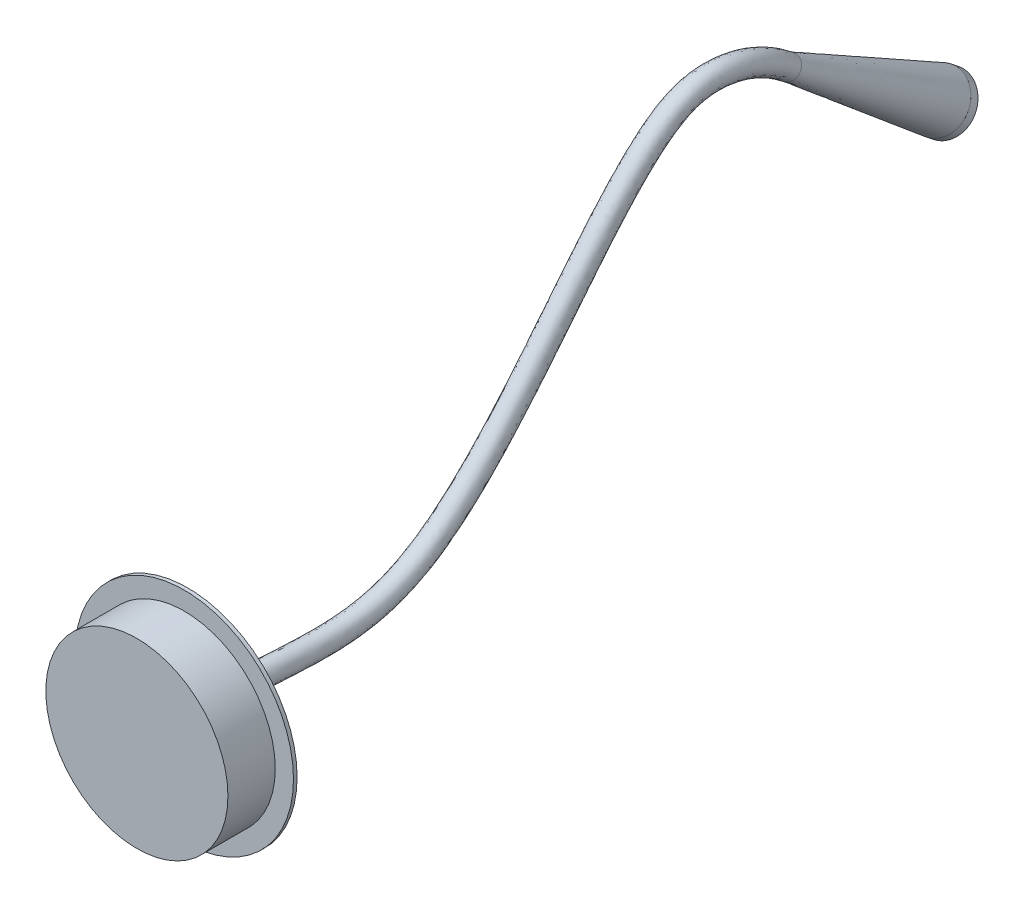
ISO-10303-21;
HEADER;
FILE_DESCRIPTION(('STEP AP214'),'2;1');
FILE_NAME('part.step','',(''),(''),'','','');
FILE_SCHEMA(('AUTOMOTIVE_DESIGN { 1 0 10303 214 1 1 1 1 }'));
ENDSEC;
DATA;
#1=APPLICATION_CONTEXT('core data for automotive mechanical design processes');
#2=APPLICATION_PROTOCOL_DEFINITION('international standard','automotive_design',2000,#1);
#3=PRODUCT_CONTEXT('',#1,'mechanical');
#4=PRODUCT('Part','Part','',(#3));
#5=PRODUCT_RELATED_PRODUCT_CATEGORY('part','',(#4));
#6=PRODUCT_DEFINITION_FORMATION('','',#4);
#7=PRODUCT_DEFINITION_CONTEXT('part definition',#1,'design');
#8=PRODUCT_DEFINITION('design','',#6,#7);
#9=PRODUCT_DEFINITION_SHAPE('','',#8);
#10=(LENGTH_UNIT() NAMED_UNIT(*) SI_UNIT(.MILLI.,.METRE.));
#11=(NAMED_UNIT(*) PLANE_ANGLE_UNIT() SI_UNIT($,.RADIAN.));
#12=(NAMED_UNIT(*) SI_UNIT($,.STERADIAN.) SOLID_ANGLE_UNIT());
#13=UNCERTAINTY_MEASURE_WITH_UNIT(LENGTH_MEASURE(1.E-05),#10,'distance_accuracy_value','');
#14=(GEOMETRIC_REPRESENTATION_CONTEXT(3) GLOBAL_UNCERTAINTY_ASSIGNED_CONTEXT((#13)) GLOBAL_UNIT_ASSIGNED_CONTEXT((#10,
#11,#12)) REPRESENTATION_CONTEXT('',''));
#15=CARTESIAN_POINT('',(0.,0.,0.));
#16=DIRECTION('',(0.,0.,1.));
#17=DIRECTION('',(1.,0.,0.));
#18=AXIS2_PLACEMENT_3D('',#15,#16,#17);
#19=CARTESIAN_POINT('',(1.,-35.1335205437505,-27.));
#20=DIRECTION('',(0.,1.,0.));
#21=DIRECTION('',(0.,0.,1.));
#22=AXIS2_PLACEMENT_3D('',#19,#20,#21);
#23=PLANE('',#22);
#24=DIRECTION('',(0.,0.,-1.));
#25=VECTOR('',#24,1.);
#26=CARTESIAN_POINT('',(-1.,-35.1335205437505,-27.));
#27=LINE('',#26,#25);
#28=CARTESIAN_POINT('',(-1.,-35.1335205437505,-27.));
#29=VERTEX_POINT('',#28);
#30=CARTESIAN_POINT('',(-1.,-35.1335205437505,-28.));
#31=VERTEX_POINT('',#30);
#32=EDGE_CURVE('E132',#29,#31,#27,.T.);
#33=ORIENTED_EDGE('',*,*,#32,.T.);
#34=DIRECTION('',(-1.,0.,0.));
#35=VECTOR('',#34,1.);
#36=CARTESIAN_POINT('',(1.,-35.1335205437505,-28.));
#37=LINE('',#36,#35);
#38=CARTESIAN_POINT('',(1.,-35.1335205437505,-28.));
#39=VERTEX_POINT('',#38);
#40=EDGE_CURVE('E115',#39,#31,#37,.T.);
#41=ORIENTED_EDGE('',*,*,#40,.F.);
#42=DIRECTION('',(0.,0.,-1.));
#43=VECTOR('',#42,1.);
#44=CARTESIAN_POINT('',(1.,-35.1335205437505,-27.));
#45=LINE('',#44,#43);
#46=CARTESIAN_POINT('',(1.,-35.1335205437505,-27.));
#47=VERTEX_POINT('',#46);
#48=EDGE_CURVE('E120',#47,#39,#45,.T.);
#49=ORIENTED_EDGE('',*,*,#48,.F.);
#50=DIRECTION('',(-1.,0.,0.));
#51=VECTOR('',#50,1.);
#52=CARTESIAN_POINT('',(1.,-35.1335205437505,-27.));
#53=LINE('',#52,#51);
#54=EDGE_CURVE('E139',#47,#29,#53,.T.);
#55=ORIENTED_EDGE('',*,*,#54,.T.);
#56=EDGE_LOOP('',(#33,#41,#49,#55));
#57=FACE_BOUND('',#56,.T.);
#58=ADVANCED_FACE('F68',(#57),#23,.F.);
#59=CARTESIAN_POINT('',(1.,-35.1335205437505,-28.));
#60=DIRECTION('',(0.,0.208487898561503,0.97802494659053));
#61=DIRECTION('',(0.,-0.97802494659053,0.208487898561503));
#62=AXIS2_PLACEMENT_3D('',#59,#60,#61);
#63=PLANE('',#62);
#64=DIRECTION('',(0.,0.97802494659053,-0.208487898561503));
#65=VECTOR('',#64,1.);
#66=CARTESIAN_POINT('',(-1.,-35.1335205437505,-28.));
#67=LINE('',#66,#65);
#68=CARTESIAN_POINT('',(-1.,-22.2688902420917,-30.7423837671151));
#69=VERTEX_POINT('',#68);
#70=EDGE_CURVE('E147',#31,#69,#67,.T.);
#71=ORIENTED_EDGE('',*,*,#70,.T.);
#72=DIRECTION('',(-1.,0.,0.));
#73=VECTOR('',#72,1.);
#74=CARTESIAN_POINT('',(1.,-22.2688902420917,-30.7423837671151));
#75=LINE('',#74,#73);
#76=CARTESIAN_POINT('',(1.,-22.2688902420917,-30.7423837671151));
#77=VERTEX_POINT('',#76);
#78=EDGE_CURVE('E76',#69,#77,#75,.F.);
#79=ORIENTED_EDGE('',*,*,#78,.T.);
#80=DIRECTION('',(0.,0.97802494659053,-0.208487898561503));
#81=VECTOR('',#80,1.);
#82=CARTESIAN_POINT('',(1.,-35.1335205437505,-28.));
#83=LINE('',#82,#81);
#84=EDGE_CURVE('E111',#39,#77,#83,.T.);
#85=ORIENTED_EDGE('',*,*,#84,.F.);
#86=ORIENTED_EDGE('',*,*,#40,.T.);
#87=EDGE_LOOP('',(#71,#79,#85,#86));
#88=FACE_BOUND('',#87,.T.);
#89=ADVANCED_FACE('F113',(#88),#63,.F.);
#90=CARTESIAN_POINT('',(1.,-21.0604023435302,-27.));
#91=DIRECTION('',(0.,-1.,0.));
#92=DIRECTION('',(0.,0.,-1.));
#93=AXIS2_PLACEMENT_3D('',#90,#91,#92);
#94=PLANE('',#93);
#95=DIRECTION('',(0.,0.,1.));
#96=VECTOR('',#95,1.);
#97=CARTESIAN_POINT('',(1.,-21.0604023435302,-27.));
#98=LINE('',#97,#96);
#99=CARTESIAN_POINT('',(1.,-21.0604023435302,-29.7643588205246));
#100=VERTEX_POINT('',#99);
#101=CARTESIAN_POINT('',(1.,-21.0604023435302,-27.));
#102=VERTEX_POINT('',#101);
#103=EDGE_CURVE('E119',#100,#102,#98,.T.);
#104=ORIENTED_EDGE('',*,*,#103,.F.);
#105=DIRECTION('',(-1.,0.,0.));
#106=VECTOR('',#105,1.);
#107=CARTESIAN_POINT('',(1.,-21.0604023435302,-29.7643588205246));
#108=LINE('',#107,#106);
#109=CARTESIAN_POINT('',(-1.,-21.0604023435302,-29.7643588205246));
#110=VERTEX_POINT('',#109);
#111=EDGE_CURVE('E133',#100,#110,#108,.T.);
#112=ORIENTED_EDGE('',*,*,#111,.T.);
#113=DIRECTION('',(0.,0.,1.));
#114=VECTOR('',#113,1.);
#115=CARTESIAN_POINT('',(-1.,-21.0604023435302,-27.));
#116=LINE('',#115,#114);
#117=CARTESIAN_POINT('',(-1.,-21.0604023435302,-27.));
#118=VERTEX_POINT('',#117);
#119=EDGE_CURVE('E145',#110,#118,#116,.T.);
#120=ORIENTED_EDGE('',*,*,#119,.T.);
#121=DIRECTION('',(-1.,0.,0.));
#122=VECTOR('',#121,1.);
#123=CARTESIAN_POINT('',(1.,-21.0604023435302,-27.));
#124=LINE('',#123,#122);
#125=EDGE_CURVE('E134',#102,#118,#124,.T.);
#126=ORIENTED_EDGE('',*,*,#125,.F.);
#127=EDGE_LOOP('',(#104,#112,#120,#126));
#128=FACE_BOUND('',#127,.T.);
#129=ADVANCED_FACE('F155',(#128),#94,.F.);
#130=CARTESIAN_POINT('',(1.,-35.1335205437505,-27.));
#131=DIRECTION('',(0.,0.,-1.));
#132=DIRECTION('',(-1.,0.,0.));
#133=AXIS2_PLACEMENT_3D('',#130,#131,#132);
#134=PLANE('',#133);
#135=DIRECTION('',(0.,-1.,0.));
#136=VECTOR('',#135,1.);
#137=CARTESIAN_POINT('',(-1.,-35.1335205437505,-27.));
#138=LINE('',#137,#136);
#139=EDGE_CURVE('E129',#118,#29,#138,.T.);
#140=ORIENTED_EDGE('',*,*,#139,.T.);
#141=ORIENTED_EDGE('',*,*,#54,.F.);
#142=DIRECTION('',(0.,-1.,0.));
#143=VECTOR('',#142,1.);
#144=CARTESIAN_POINT('',(1.,-35.1335205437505,-27.));
#145=LINE('',#144,#143);
#146=EDGE_CURVE('E125',#102,#47,#145,.T.);
#147=ORIENTED_EDGE('',*,*,#146,.F.);
#148=ORIENTED_EDGE('',*,*,#125,.T.);
#149=EDGE_LOOP('',(#140,#141,#147,#148));
#150=FACE_BOUND('',#149,.T.);
#151=ADVANCED_FACE('F158',(#150),#134,.F.);
#152=CARTESIAN_POINT('',(1.,0.,0.));
#153=DIRECTION('',(1.,0.,0.));
#154=DIRECTION('',(0.,0.,-1.));
#155=AXIS2_PLACEMENT_3D('',#152,#153,#154);
#156=PLANE('',#155);
#157=ORIENTED_EDGE('',*,*,#84,.T.);
#158=CARTESIAN_POINT('',(1.,-22.0604023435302,-29.7643588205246));
#159=DIRECTION('',(1.,0.,0.));
#160=DIRECTION('',(0.,0.,-1.));
#161=AXIS2_PLACEMENT_3D('',#158,#159,#160);
#162=CIRCLE('',#161,1.);
#163=EDGE_CURVE('E13',#77,#100,#162,.T.);
#164=ORIENTED_EDGE('',*,*,#163,.T.);
#165=ORIENTED_EDGE('',*,*,#103,.T.);
#166=ORIENTED_EDGE('',*,*,#146,.T.);
#167=ORIENTED_EDGE('',*,*,#48,.T.);
#168=EDGE_LOOP('',(#157,#164,#165,#166,#167));
#169=FACE_BOUND('',#168,.T.);
#170=ADVANCED_FACE('F123',(#169),#156,.T.);
#171=CARTESIAN_POINT('',(-1.,0.,0.));
#172=DIRECTION('',(1.,0.,0.));
#173=DIRECTION('',(0.,0.,-1.));
#174=AXIS2_PLACEMENT_3D('',#171,#172,#173);
#175=PLANE('',#174);
#176=ORIENTED_EDGE('',*,*,#119,.F.);
#177=CARTESIAN_POINT('',(-1.,-22.0604023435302,-29.7643588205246));
#178=DIRECTION('',(1.,0.,0.));
#179=DIRECTION('',(0.,0.,-1.));
#180=AXIS2_PLACEMENT_3D('',#177,#178,#179);
#181=CIRCLE('',#180,1.);
#182=EDGE_CURVE('E90',#110,#69,#181,.F.);
#183=ORIENTED_EDGE('',*,*,#182,.T.);
#184=ORIENTED_EDGE('',*,*,#70,.F.);
#185=ORIENTED_EDGE('',*,*,#32,.F.);
#186=ORIENTED_EDGE('',*,*,#139,.F.);
#187=EDGE_LOOP('',(#176,#183,#184,#185,#186));
#188=FACE_BOUND('',#187,.T.);
#189=ADVANCED_FACE('F159',(#188),#175,.F.);
#190=CARTESIAN_POINT('',(1.,-22.0604023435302,-29.7643588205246));
#191=DIRECTION('',(-1.,0.,0.));
#192=DIRECTION('',(0.,0.,1.));
#193=AXIS2_PLACEMENT_3D('',#190,#191,#192);
#194=CYLINDRICAL_SURFACE('',#193,1.);
#195=ORIENTED_EDGE('',*,*,#163,.F.);
#196=ORIENTED_EDGE('',*,*,#78,.F.);
#197=ORIENTED_EDGE('',*,*,#182,.F.);
#198=ORIENTED_EDGE('',*,*,#111,.F.);
#199=EDGE_LOOP('',(#195,#196,#197,#198));
#200=FACE_BOUND('',#199,.T.);
#201=ADVANCED_FACE('F70',(#200),#194,.T.);
#202=CLOSED_SHELL('',(#58,#89,#129,#151,#170,#189,#201));
#203=MANIFOLD_SOLID_BREP('B2',#202);
#204=CARTESIAN_POINT('',(0.,82.5090098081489,-444.259982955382));
#205=DIRECTION('',(0.,0.621224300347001,0.783632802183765));
#206=DIRECTION('',(0.,-0.783632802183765,0.621224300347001));
#207=AXIS2_PLACEMENT_3D('',#204,#205,#206);
#208=CYLINDRICAL_SURFACE('',#207,14.9999999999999);
#209=CARTESIAN_POINT('',(0.,82.5090098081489,-444.259982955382));
#210=DIRECTION('',(0.,-0.621224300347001,-0.783632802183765));
#211=DIRECTION('',(0.,0.783632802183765,-0.621224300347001));
#212=AXIS2_PLACEMENT_3D('',#209,#210,#211);
#213=CIRCLE('',#212,14.9999999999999);
#214=CARTESIAN_POINT('',(0.,94.2635018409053,-453.578347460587));
#215=VERTEX_POINT('',#214);
#216=EDGE_CURVE('E67',#215,#215,#213,.T.);
#217=ORIENTED_EDGE('',*,*,#216,.F.);
#218=EDGE_LOOP('',(#217));
#219=FACE_BOUND('',#218,.T.);
#220=CARTESIAN_POINT('',(0.,85.6151313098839,-440.341818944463));
#221=DIRECTION('',(0.,-0.621224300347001,-0.783632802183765));
#222=DIRECTION('',(0.,0.783632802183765,-0.621224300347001));
#223=AXIS2_PLACEMENT_3D('',#220,#221,#222);
#224=CIRCLE('',#223,14.9999999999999);
#225=CARTESIAN_POINT('',(0.,97.3696233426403,-449.660183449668));
#226=VERTEX_POINT('',#225);
#227=EDGE_CURVE('E229',#226,#226,#224,.T.);
#228=ORIENTED_EDGE('',*,*,#227,.T.);
#229=EDGE_LOOP('',(#228));
#230=FACE_BOUND('',#229,.T.);
#231=ADVANCED_FACE('F226',(#219,#230),#208,.T.);
#232=CARTESIAN_POINT('',(0.,82.5090098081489,-444.259982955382));
#233=DIRECTION('',(0.,-0.621224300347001,-0.783632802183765));
#234=DIRECTION('',(0.,0.783632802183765,-0.621224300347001));
#235=AXIS2_PLACEMENT_3D('',#232,#233,#234);
#236=PLANE('',#235);
#237=CARTESIAN_POINT('',(0.,82.5090098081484,-444.259982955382));
#238=DIRECTION('',(0.,-0.621224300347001,-0.783632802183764));
#239=DIRECTION('',(0.,0.783632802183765,-0.621224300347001));
#240=AXIS2_PLACEMENT_3D('',#237,#238,#239);
#241=CIRCLE('',#240,13.);
#242=CARTESIAN_POINT('',(0.,92.6962362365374,-452.335898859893));
#243=VERTEX_POINT('',#242);
#244=EDGE_CURVE('E238',#243,#243,#241,.T.);
#245=ORIENTED_EDGE('',*,*,#244,.F.);
#246=EDGE_LOOP('',(#245));
#247=FACE_BOUND('',#246,.T.);
#248=ORIENTED_EDGE('',*,*,#216,.T.);
#249=EDGE_LOOP('',(#248));
#250=FACE_BOUND('',#249,.T.);
#251=ADVANCED_FACE('F253',(#247,#250),#236,.T.);
#252=CARTESIAN_POINT('',(0.,85.6151313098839,-440.341818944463));
#253=DIRECTION('',(0.,-0.621224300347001,-0.783632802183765));
#254=DIRECTION('',(0.,0.783632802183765,-0.621224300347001));
#255=AXIS2_PLACEMENT_3D('',#252,#253,#254);
#256=PLANE('',#255);
#257=ORIENTED_EDGE('',*,*,#227,.F.);
#258=EDGE_LOOP('',(#257));
#259=FACE_BOUND('',#258,.T.);
#260=ADVANCED_FACE('F249',(#259),#256,.F.);
#261=CARTESIAN_POINT('',(0.,83.7514584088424,-442.692717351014));
#262=DIRECTION('',(0.,-0.621224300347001,-0.783632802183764));
#263=DIRECTION('',(0.,0.783632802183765,-0.621224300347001));
#264=AXIS2_PLACEMENT_3D('',#261,#262,#263);
#265=CYLINDRICAL_SURFACE('',#264,13.);
#266=CARTESIAN_POINT('',(0.,83.7514584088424,-442.692717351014));
#267=DIRECTION('',(0.,-0.621224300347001,-0.783632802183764));
#268=DIRECTION('',(0.,0.783632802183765,-0.621224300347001));
#269=AXIS2_PLACEMENT_3D('',#266,#267,#268);
#270=CIRCLE('',#269,13.);
#271=CARTESIAN_POINT('',(0.,93.9386848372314,-450.768633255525));
#272=VERTEX_POINT('',#271);
#273=EDGE_CURVE('E236',#272,#272,#270,.T.);
#274=CARTESIAN_POINT('',(0.,93.9386848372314,-450.768633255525));
#275=CARTESIAN_POINT('',(0.,93.9257426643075,-450.784958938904));
#276=CARTESIAN_POINT('',(0.,93.9128004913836,-450.801284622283));
#277=CARTESIAN_POINT('',(0.,93.8869161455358,-450.833935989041));
#278=CARTESIAN_POINT('',(0.,93.8739739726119,-450.850261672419));
#279=CARTESIAN_POINT('',(0.,93.8480896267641,-450.882913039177));
#280=CARTESIAN_POINT('',(0.,93.8351474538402,-450.899238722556));
#281=CARTESIAN_POINT('',(0.,93.8092631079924,-450.931890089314));
#282=CARTESIAN_POINT('',(0.,93.7963209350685,-450.948215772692));
#283=CARTESIAN_POINT('',(0.,93.7704365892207,-450.98086713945));
#284=CARTESIAN_POINT('',(0.,93.7574944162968,-450.997192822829));
#285=CARTESIAN_POINT('',(0.,93.731610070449,-451.029844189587));
#286=CARTESIAN_POINT('',(0.,93.7186678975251,-451.046169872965));
#287=CARTESIAN_POINT('',(0.,93.6927835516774,-451.078821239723));
#288=CARTESIAN_POINT('',(0.,93.6798413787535,-451.095146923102));
#289=CARTESIAN_POINT('',(0.,93.6539570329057,-451.12779828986));
#290=CARTESIAN_POINT('',(0.,93.6410148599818,-451.144123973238));
#291=CARTESIAN_POINT('',(0.,93.615130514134,-451.176775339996));
#292=CARTESIAN_POINT('',(0.,93.6021883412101,-451.193101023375));
#293=CARTESIAN_POINT('',(0.,93.5763039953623,-451.225752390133));
#294=CARTESIAN_POINT('',(0.,93.5633618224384,-451.242078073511));
#295=CARTESIAN_POINT('',(0.,93.5374774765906,-451.274729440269));
#296=CARTESIAN_POINT('',(0.,93.5245353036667,-451.291055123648));
#297=CARTESIAN_POINT('',(0.,93.4986509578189,-451.323706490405));
#298=CARTESIAN_POINT('',(0.,93.485708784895,-451.340032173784));
#299=CARTESIAN_POINT('',(0.,93.4598244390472,-451.372683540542));
#300=CARTESIAN_POINT('',(0.,93.4468822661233,-451.389009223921));
#301=CARTESIAN_POINT('',(0.,93.4209979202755,-451.421660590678));
#302=CARTESIAN_POINT('',(0.,93.4080557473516,-451.437986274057));
#303=CARTESIAN_POINT('',(0.,93.3821714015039,-451.470637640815));
#304=CARTESIAN_POINT('',(0.,93.3692292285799,-451.486963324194));
#305=CARTESIAN_POINT('',(0.,93.3433448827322,-451.519614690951));
#306=CARTESIAN_POINT('',(0.,93.3304027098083,-451.53594037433));
#307=CARTESIAN_POINT('',(0.,93.3045183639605,-451.568591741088));
#308=CARTESIAN_POINT('',(0.,93.2915761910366,-451.584917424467));
#309=CARTESIAN_POINT('',(0.,93.2656918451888,-451.617568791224));
#310=CARTESIAN_POINT('',(0.,93.2527496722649,-451.633894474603));
#311=CARTESIAN_POINT('',(0.,93.2268653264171,-451.666545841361));
#312=CARTESIAN_POINT('',(0.,93.2139231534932,-451.68287152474));
#313=CARTESIAN_POINT('',(0.,93.1880388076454,-451.715522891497));
#314=CARTESIAN_POINT('',(0.,93.1750966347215,-451.731848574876));
#315=CARTESIAN_POINT('',(0.,93.1492122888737,-451.764499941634));
#316=CARTESIAN_POINT('',(0.,93.1362701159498,-451.780825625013));
#317=CARTESIAN_POINT('',(0.,93.110385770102,-451.81347699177));
#318=CARTESIAN_POINT('',(0.,93.0974435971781,-451.829802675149));
#319=CARTESIAN_POINT('',(0.,93.0715592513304,-451.862454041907));
#320=CARTESIAN_POINT('',(0.,93.0586170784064,-451.878779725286));
#321=CARTESIAN_POINT('',(0.,93.0327327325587,-451.911431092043));
#322=CARTESIAN_POINT('',(0.,93.0197905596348,-451.927756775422));
#323=CARTESIAN_POINT('',(0.,92.993906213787,-451.96040814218));
#324=CARTESIAN_POINT('',(0.,92.9809640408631,-451.976733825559));
#325=CARTESIAN_POINT('',(0.,92.9550796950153,-452.009385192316));
#326=CARTESIAN_POINT('',(0.,92.9421375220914,-452.025710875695));
#327=CARTESIAN_POINT('',(0.,92.9162531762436,-452.058362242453));
#328=CARTESIAN_POINT('',(0.,92.9033110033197,-452.074687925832));
#329=CARTESIAN_POINT('',(0.,92.8774266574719,-452.107339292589));
#330=CARTESIAN_POINT('',(0.,92.864484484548,-452.123664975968));
#331=CARTESIAN_POINT('',(0.,92.8386001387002,-452.156316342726));
#332=CARTESIAN_POINT('',(0.,92.8256579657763,-452.172642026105));
#333=CARTESIAN_POINT('',(0.,92.7997736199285,-452.205293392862));
#334=CARTESIAN_POINT('',(0.,92.7868314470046,-452.221619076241));
#335=CARTESIAN_POINT('',(0.,92.7609471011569,-452.254270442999));
#336=CARTESIAN_POINT('',(0.,92.748004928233,-452.270596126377));
#337=CARTESIAN_POINT('',(0.,92.7221205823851,-452.303247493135));
#338=CARTESIAN_POINT('',(0.,92.7091784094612,-452.319573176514));
#339=CARTESIAN_POINT('',(0.,92.6962362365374,-452.335898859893));
#340=B_SPLINE_CURVE_WITH_KNOTS('',3,(#274,#275,#276,#277,#278,#279,#280,#281,#282,#283,#284,
#285,#286,#287,#288,#289,#290,#291,#292,#293,#294,#295,#296,#297,#298,#299,#300,#301,#302,#303,
#304,#305,#306,#307,#308,#309,#310,#311,#312,#313,#314,#315,#316,#317,#318,#319,#320,#321,#322,
#323,#324,#325,#326,#327,#328,#329,#330,#331,#332,#333,#334,#335,#336,#337,#338,#339),
.UNSPECIFIED.,.F.,.F.,(4,2,2,2,2,2,2,2,2,2,2,2,2,2,2,2,2,2,2,2,2,2,2,2,2,2,2,2,2,2,2,2,4),(0.,
0.0625000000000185,0.124999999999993,0.187500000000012,0.249999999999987,0.312500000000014,
0.374999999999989,0.437500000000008,0.499999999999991,0.56250000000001,0.624999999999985,
0.687500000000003,0.749999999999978,0.812500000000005,0.875000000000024,0.937499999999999,
1.00000000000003,1.0625,1.12500000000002,1.18749999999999,1.25000000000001,1.3125,
1.37500000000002,1.43749999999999,1.50000000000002,1.56249999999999,1.62500000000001,
1.68749999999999,1.75,1.81249999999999,1.87500000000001,1.93749999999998,2.00000000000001),.UNSPECIFIED.);
#341=EDGE_CURVE('BSEAM246',#272,#243,#340,.T.);
#342=ORIENTED_EDGE('',*,*,#273,.F.);
#343=ORIENTED_EDGE('',*,*,#244,.T.);
#344=ORIENTED_EDGE('',*,*,#341,.T.);
#345=ORIENTED_EDGE('',*,*,#341,.F.);
#346=EDGE_LOOP('',(#342,#344,#343,#345));
#347=FACE_BOUND('',#346,.T.);
#348=ADVANCED_FACE('F246',(#347),#265,.F.);
#349=CARTESIAN_POINT('',(0.,83.7514584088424,-442.692717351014));
#350=DIRECTION('',(0.,-0.621224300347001,-0.783632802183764));
#351=DIRECTION('',(0.,0.783632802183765,-0.621224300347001));
#352=AXIS2_PLACEMENT_3D('',#349,#350,#351);
#353=PLANE('',#352);
#354=ORIENTED_EDGE('',*,*,#273,.T.);
#355=EDGE_LOOP('',(#354));
#356=FACE_BOUND('',#355,.T.);
#357=ADVANCED_FACE('F244',(#356),#353,.T.);
#358=CLOSED_SHELL('',(#231,#251,#260,#348,#357));
#359=MANIFOLD_SOLID_BREP('B7',#358);
#360=CARTESIAN_POINT('',(0.,85.6151313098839,-440.341818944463));
#361=DIRECTION('',(0.,0.621224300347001,0.783632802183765));
#362=DIRECTION('',(0.,-0.783632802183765,0.621224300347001));
#363=AXIS2_PLACEMENT_3D('',#360,#361,#362);
#364=PLANE('',#363);
#365=CARTESIAN_POINT('',(0.,85.6151313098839,-440.341818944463));
#366=DIRECTION('',(0.,0.621224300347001,0.783632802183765));
#367=DIRECTION('',(0.,-0.783632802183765,0.621224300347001));
#368=AXIS2_PLACEMENT_3D('',#365,#366,#367);
#369=CIRCLE('',#368,15.);
#370=CARTESIAN_POINT('',(14.3445713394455,89.0518121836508,-443.066245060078));
#371=VERTEX_POINT('',#370);
#372=EDGE_CURVE('E225',#371,#371,#369,.T.);
#373=ORIENTED_EDGE('',*,*,#372,.F.);
#374=EDGE_LOOP('',(#373));
#375=FACE_BOUND('',#374,.T.);
#376=ADVANCED_FACE('F307',(#375),#364,.F.);
#377=CARTESIAN_POINT('',(0.,142.718901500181,-358.));
#378=DIRECTION('',(0.,-0.621224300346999,-0.783632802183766));
#379=DIRECTION('',(0.,0.783632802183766,-0.621224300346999));
#380=AXIS2_PLACEMENT_3D('',#377,#378,#379);
#381=PLANE('',#380);
#382=CARTESIAN_POINT('',(0.,142.718901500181,-358.));
#383=DIRECTION('',(0.,-0.621224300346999,-0.783632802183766));
#384=DIRECTION('',(0.,0.783632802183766,-0.621224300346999));
#385=AXIS2_PLACEMENT_3D('',#382,#383,#384);
#386=CIRCLE('',#385,6.);
#387=CARTESIAN_POINT('',(5.6153248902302,144.375340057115,-359.313140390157));
#388=VERTEX_POINT('',#387);
#389=EDGE_CURVE('E315',#388,#388,#386,.T.);
#390=ORIENTED_EDGE('',*,*,#389,.F.);
#391=EDGE_LOOP('',(#390));
#392=FACE_BOUND('',#391,.T.);
#393=ADVANCED_FACE('F340',(#392),#381,.F.);
#394=CARTESIAN_POINT('',(5.6153248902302,144.375340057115,-359.313140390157));
#395=CARTESIAN_POINT('',(14.3445713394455,89.0518121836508,-443.066245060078));
#396=CARTESIAN_POINT('',(5.70339965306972,144.191992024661,-359.167791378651));
#397=CARTESIAN_POINT('',(14.5273036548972,88.5834423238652,-442.694945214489));
#398=CARTESIAN_POINT('',(5.7830266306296,143.992420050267,-359.009580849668));
#399=CARTESIAN_POINT('',(14.6844984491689,88.0766264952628,-442.293167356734));
#400=CARTESIAN_POINT('',(5.91042857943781,143.559933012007,-358.666727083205));
#401=CARTESIAN_POINT('',(14.9150701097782,86.9818681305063,-441.425298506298));
#402=CARTESIAN_POINT('',(5.95820355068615,143.327017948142,-358.482083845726));
#403=CARTESIAN_POINT('',(14.9884204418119,86.3937534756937,-440.959071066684));
#404=CARTESIAN_POINT('',(6.00694505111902,142.826949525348,-358.085654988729));
#405=CARTESIAN_POINT('',(15.0090788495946,85.1400455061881,-439.965195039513));
#406=CARTESIAN_POINT('',(6.00734695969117,142.560113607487,-357.874121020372));
#407=CARTESIAN_POINT('',(14.9562141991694,84.4742427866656,-439.437380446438));
#408=CARTESIAN_POINT('',(5.94015796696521,141.999067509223,-357.429352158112));
#409=CARTESIAN_POINT('',(14.6753173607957,83.0827677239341,-438.334289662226));
#410=CARTESIAN_POINT('',(5.87241379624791,141.704783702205,-357.196058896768));
#411=CARTESIAN_POINT('',(14.4468879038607,82.3569306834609,-437.758882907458));
#412=CARTESIAN_POINT('',(5.64865919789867,141.102897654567,-356.718914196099));
#413=CARTESIAN_POINT('',(13.7671169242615,80.8829693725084,-436.590401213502));
#414=CARTESIAN_POINT('',(5.49240254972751,140.795299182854,-356.475065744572));
#415=CARTESIAN_POINT('',(13.3151618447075,80.134885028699,-435.997357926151));
#416=CARTESIAN_POINT('',(5.07730379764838,140.190165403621,-355.995346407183));
#417=CARTESIAN_POINT('',(12.1573335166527,78.6765410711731,-434.841256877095));
#418=CARTESIAN_POINT('',(4.81820447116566,139.89278230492,-355.759596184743));
#419=CARTESIAN_POINT('',(11.4508492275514,77.9666931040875,-434.27852544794));
#420=CARTESIAN_POINT('',(4.19703243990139,139.338693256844,-355.320342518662));
#421=CARTESIAN_POINT('',(9.78917480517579,76.6612515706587,-433.243637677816));
#422=CARTESIAN_POINT('',(3.83486334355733,139.082288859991,-355.117078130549));
#423=CARTESIAN_POINT('',(8.83380505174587,76.0664223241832,-432.772087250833));
#424=CARTESIAN_POINT('',(3.02711326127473,138.641076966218,-354.767307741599));
#425=CARTESIAN_POINT('',(6.72940732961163,75.0657377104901,-431.978795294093));
#426=CARTESIAN_POINT('',(2.58173804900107,138.456585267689,-354.621052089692));
#427=CARTESIAN_POINT('',(5.58095651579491,74.6606447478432,-431.657658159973));
#428=CARTESIAN_POINT('',(1.64585056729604,138.180512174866,-354.402195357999));
#429=CARTESIAN_POINT('',(3.19019462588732,74.0878646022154,-431.203587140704));
#430=CARTESIAN_POINT('',(1.15578132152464,138.089061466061,-354.329697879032));
#431=CARTESIAN_POINT('',(1.94901527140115,73.920448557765,-431.070868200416));
#432=CARTESIAN_POINT('',(0.177260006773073,138.00334947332,-354.261749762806));
#433=CARTESIAN_POINT('',(-0.509688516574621,73.827902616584,-430.997502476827));
#434=CARTESIAN_POINT('',(-0.310771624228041,138.008957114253,-354.266195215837));
#435=CARTESIAN_POINT('',(-1.72619042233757,73.9023935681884,-431.056555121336));
#436=CARTESIAN_POINT('',(-1.24401478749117,138.104516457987,-354.341949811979));
#437=CARTESIAN_POINT('',(-4.03533159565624,74.2565047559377,-431.337276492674));
#438=CARTESIAN_POINT('',(-1.68904502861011,138.194191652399,-354.413039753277));
#439=CARTESIAN_POINT('',(-5.1275743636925,74.5354126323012,-431.558380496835));
#440=CARTESIAN_POINT('',(-2.51032230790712,138.434612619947,-354.603633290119));
#441=CARTESIAN_POINT('',(-7.12811790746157,75.2370719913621,-432.114620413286));
#442=CARTESIAN_POINT('',(-2.88663463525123,138.585111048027,-354.72294080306));
#443=CARTESIAN_POINT('',(-8.03663151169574,75.6592144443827,-432.449273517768));
#444=CARTESIAN_POINT('',(-3.56133201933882,138.921966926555,-354.989983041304));
#445=CARTESIAN_POINT('',(-9.65199194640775,76.5833068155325,-433.181847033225));
#446=CARTESIAN_POINT('',(-3.85989900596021,139.108194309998,-355.137614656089));
#447=CARTESIAN_POINT('',(-10.3593189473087,77.0849547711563,-433.579528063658));
#448=CARTESIAN_POINT('',(-4.38252825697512,139.49525266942,-355.444454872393));
#449=CARTESIAN_POINT('',(-11.585136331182,78.1154503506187,-434.396452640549));
#450=CARTESIAN_POINT('',(-4.60676770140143,139.696059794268,-355.603644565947));
#451=CARTESIAN_POINT('',(-12.1040735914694,78.6442604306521,-434.815666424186));
#452=CARTESIAN_POINT('',(-4.99093127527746,140.097183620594,-355.921635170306));
#453=CARTESIAN_POINT('',(-12.981581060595,79.6926839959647,-435.646803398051));
#454=CARTESIAN_POINT('',(-5.15101274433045,140.296969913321,-356.080015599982));
#455=CARTESIAN_POINT('',(-13.340443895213,80.2123953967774,-436.058804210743));
#456=CARTESIAN_POINT('',(-5.41917217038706,140.68793555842,-356.389953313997));
#457=CARTESIAN_POINT('',(-13.9305004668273,81.2210281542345,-436.85839705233));
#458=CARTESIAN_POINT('',(-5.52725012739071,140.879114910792,-356.541510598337));
#459=CARTESIAN_POINT('',(-14.1618390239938,81.7100805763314,-437.24609298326));
#460=CARTESIAN_POINT('',(-5.70339965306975,141.245810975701,-356.832208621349));
#461=CARTESIAN_POINT('',(-14.5273036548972,82.6468202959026,-437.988692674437));
#462=CARTESIAN_POINT('',(-5.78302663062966,141.445382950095,-356.990419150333));
#463=CARTESIAN_POINT('',(-14.6844984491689,83.1536361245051,-438.390470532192));
#464=CARTESIAN_POINT('',(-5.91042857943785,141.877869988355,-357.333272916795));
#465=CARTESIAN_POINT('',(-14.9150701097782,84.2483944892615,-439.258339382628));
#466=CARTESIAN_POINT('',(-5.95820355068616,142.11078505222,-357.517916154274));
#467=CARTESIAN_POINT('',(-14.9884204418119,84.8365091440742,-439.724566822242));
#468=CARTESIAN_POINT('',(-6.00694505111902,142.610853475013,-357.914345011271));
#469=CARTESIAN_POINT('',(-15.0090788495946,86.0902171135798,-440.718442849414));
#470=CARTESIAN_POINT('',(-6.00734695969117,142.877689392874,-358.125878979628));
#471=CARTESIAN_POINT('',(-14.9562141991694,86.7560198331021,-441.246257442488));
#472=CARTESIAN_POINT('',(-5.94015796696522,143.438735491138,-358.570647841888));
#473=CARTESIAN_POINT('',(-14.6753173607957,88.1474948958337,-442.349348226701));
#474=CARTESIAN_POINT('',(-5.87241379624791,143.733019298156,-358.803941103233));
#475=CARTESIAN_POINT('',(-14.4468879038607,88.8733319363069,-442.924754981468));
#476=CARTESIAN_POINT('',(-5.64865919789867,144.334905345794,-359.281085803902));
#477=CARTESIAN_POINT('',(-13.7671169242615,90.3472932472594,-444.093236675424));
#478=CARTESIAN_POINT('',(-5.4924025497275,144.642503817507,-359.524934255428));
#479=CARTESIAN_POINT('',(-13.3151618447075,91.0953775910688,-444.686279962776));
#480=CARTESIAN_POINT('',(-5.07730379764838,145.24763759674,-360.004653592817));
#481=CARTESIAN_POINT('',(-12.1573335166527,92.5537215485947,-445.842381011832));
#482=CARTESIAN_POINT('',(-4.81820447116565,145.545020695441,-360.240403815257));
#483=CARTESIAN_POINT('',(-11.4508492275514,93.2635695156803,-446.405112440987));
#484=CARTESIAN_POINT('',(-4.19703243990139,146.099109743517,-360.679657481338));
#485=CARTESIAN_POINT('',(-9.78917480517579,94.5690110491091,-447.440000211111));
#486=CARTESIAN_POINT('',(-3.83486334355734,146.35551414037,-360.882921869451));
#487=CARTESIAN_POINT('',(-8.83380505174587,95.1638402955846,-447.911550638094));
#488=CARTESIAN_POINT('',(-3.02711326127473,146.796726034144,-361.232692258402));
#489=CARTESIAN_POINT('',(-6.72940732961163,96.1645249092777,-448.704842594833));
#490=CARTESIAN_POINT('',(-2.58173804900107,146.981217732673,-361.378947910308));
#491=CARTESIAN_POINT('',(-5.5809565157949,96.5696178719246,-449.025979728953));
#492=CARTESIAN_POINT('',(-1.64585056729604,147.257290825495,-361.597804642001));
#493=CARTESIAN_POINT('',(-3.19019462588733,97.1423980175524,-449.480050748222));
#494=CARTESIAN_POINT('',(-1.15578132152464,147.348741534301,-361.670302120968));
#495=CARTESIAN_POINT('',(-1.94901527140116,97.3098140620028,-449.61276968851));
#496=CARTESIAN_POINT('',(-0.177260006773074,147.434453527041,-361.738250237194));
#497=CARTESIAN_POINT('',(0.509688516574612,97.4023600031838,-449.686135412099));
#498=CARTESIAN_POINT('',(0.310771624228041,147.428845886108,-361.733804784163));
#499=CARTESIAN_POINT('',(1.72619042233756,97.3278690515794,-449.62708276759));
#500=CARTESIAN_POINT('',(1.24401478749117,147.333286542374,-361.658050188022));
#501=CARTESIAN_POINT('',(4.03533159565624,96.9737578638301,-449.346361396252));
#502=CARTESIAN_POINT('',(1.68904502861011,147.243611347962,-361.586960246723));
#503=CARTESIAN_POINT('',(5.12757436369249,96.6948499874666,-449.12525739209));
#504=CARTESIAN_POINT('',(2.51032230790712,147.003190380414,-361.396366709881));
#505=CARTESIAN_POINT('',(7.12811790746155,95.9931906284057,-448.56901747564));
#506=CARTESIAN_POINT('',(2.88663463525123,146.852691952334,-361.27705919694));
#507=CARTESIAN_POINT('',(8.03663151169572,95.5710481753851,-448.234364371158));
#508=CARTESIAN_POINT('',(3.56133201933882,146.515836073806,-361.010016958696));
#509=CARTESIAN_POINT('',(9.65199194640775,94.6469558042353,-447.501790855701));
#510=CARTESIAN_POINT('',(3.8598990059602,146.329608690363,-360.862385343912));
#511=CARTESIAN_POINT('',(10.3593189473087,94.1453078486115,-447.104109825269));
#512=CARTESIAN_POINT('',(4.38252825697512,145.942550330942,-360.555545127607));
#513=CARTESIAN_POINT('',(11.585136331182,93.114812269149,-446.287185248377));
#514=CARTESIAN_POINT('',(4.60676770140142,145.741743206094,-360.396355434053));
#515=CARTESIAN_POINT('',(12.1040735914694,92.5860021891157,-445.867971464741));
#516=CARTESIAN_POINT('',(4.99093127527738,145.340619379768,-360.078364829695));
#517=CARTESIAN_POINT('',(12.981581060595,91.5375786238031,-445.036834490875));
#518=CARTESIAN_POINT('',(5.15101274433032,145.140833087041,-359.919984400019));
#519=CARTESIAN_POINT('',(13.340443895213,91.0178672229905,-444.624833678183));
#520=CARTESIAN_POINT('',(5.41917217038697,144.749867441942,-359.610046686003));
#521=CARTESIAN_POINT('',(13.9305004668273,90.0092344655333,-443.825240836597));
#522=CARTESIAN_POINT('',(5.52725012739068,144.55868808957,-359.458489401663));
#523=CARTESIAN_POINT('',(14.1618390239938,89.5201820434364,-443.437544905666));
#524=CARTESIAN_POINT('',(5.6153248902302,144.375340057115,-359.313140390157));
#525=CARTESIAN_POINT('',(14.3445713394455,89.0518121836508,-443.066245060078));
#526=B_SPLINE_SURFACE_WITH_KNOTS('',3,1,((#394,#395),(#396,#397),(#398,#399),(#400,#401),(#402,
#403),(#404,#405),(#406,#407),(#408,#409),(#410,#411),(#412,#413),(#414,#415),(#416,#417),(#418,
#419),(#420,#421),(#422,#423),(#424,#425),(#426,#427),(#428,#429),(#430,#431),(#432,#433),(#434,
#435),(#436,#437),(#438,#439),(#440,#441),(#442,#443),(#444,#445),(#446,#447),(#448,#449),(#450,
#451),(#452,#453),(#454,#455),(#456,#457),(#458,#459),(#460,#461),(#462,#463),(#464,#465),(#466,
#467),(#468,#469),(#470,#471),(#472,#473),(#474,#475),(#476,#477),(#478,#479),(#480,#481),(#482,
#483),(#484,#485),(#486,#487),(#488,#489),(#490,#491),(#492,#493),(#494,#495),(#496,#497),(#498,
#499),(#500,#501),(#502,#503),(#504,#505),(#506,#507),(#508,#509),(#510,#511),(#512,#513),(#514,
#515),(#516,#517),(#518,#519),(#520,#521),(#522,#523),(#524,#525)),.UNSPECIFIED.,.T.,.F.,.F.,(4,
2,2,2,2,2,2,2,2,2,2,2,2,2,2,2,2,2,2,2,2,2,2,2,2,2,2,2,2,2,2,2,4),(2,2),(0.,0.03125,
0.0625000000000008,0.0937499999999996,0.124999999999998,0.156249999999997,0.187499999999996,
0.218749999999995,0.249999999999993,0.281249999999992,0.312499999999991,0.343749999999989,
0.374999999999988,0.406249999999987,0.437499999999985,0.46875,0.499999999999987,0.53125,
0.562499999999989,0.59374999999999,0.624999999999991,0.656249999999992,0.687499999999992,
0.718749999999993,0.749999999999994,0.781249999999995,0.812499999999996,0.843749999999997,
0.874999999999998,0.906249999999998,0.937499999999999,0.96875,1.),(0.,1.),.UNSPECIFIED.);
#527=CARTESIAN_POINT('',(5.6153248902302,144.375340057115,-359.313140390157));
#528=CARTESIAN_POINT('',(5.70625454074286,143.799053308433,-360.185568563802));
#529=CARTESIAN_POINT('',(5.79718419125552,143.222766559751,-361.057996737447));
#530=CARTESIAN_POINT('',(5.97904349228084,142.070193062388,-362.802853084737));
#531=CARTESIAN_POINT('',(6.0699731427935,141.493906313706,-363.675281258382));
#532=CARTESIAN_POINT('',(6.25183244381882,140.341332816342,-365.420137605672));
#533=CARTESIAN_POINT('',(6.34276209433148,139.76504606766,-366.292565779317));
#534=CARTESIAN_POINT('',(6.5246213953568,138.612472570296,-368.037422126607));
#535=CARTESIAN_POINT('',(6.61555104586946,138.036185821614,-368.909850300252));
#536=CARTESIAN_POINT('',(6.79741034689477,136.88361232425,-370.654706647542));
#537=CARTESIAN_POINT('',(6.88833999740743,136.307325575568,-371.527134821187));
#538=CARTESIAN_POINT('',(7.07019929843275,135.154752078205,-373.271991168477));
#539=CARTESIAN_POINT('',(7.16112894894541,134.578465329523,-374.144419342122));
#540=CARTESIAN_POINT('',(7.34298824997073,133.425891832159,-375.889275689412));
#541=CARTESIAN_POINT('',(7.43391790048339,132.849605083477,-376.761703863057));
#542=CARTESIAN_POINT('',(7.61577720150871,131.697031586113,-378.506560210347));
#543=CARTESIAN_POINT('',(7.70670685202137,131.120744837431,-379.378988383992));
#544=CARTESIAN_POINT('',(7.88856615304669,129.968171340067,-381.123844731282));
#545=CARTESIAN_POINT('',(7.97949580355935,129.391884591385,-381.996272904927));
#546=CARTESIAN_POINT('',(8.16135510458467,128.239311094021,-383.741129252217));
#547=CARTESIAN_POINT('',(8.25228475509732,127.66302434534,-384.613557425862));
#548=CARTESIAN_POINT('',(8.43414405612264,126.510450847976,-386.358413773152));
#549=CARTESIAN_POINT('',(8.5250737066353,125.934164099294,-387.230841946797));
#550=CARTESIAN_POINT('',(8.70693300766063,124.78159060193,-388.975698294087));
#551=CARTESIAN_POINT('',(8.79786265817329,124.205303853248,-389.848126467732));
#552=CARTESIAN_POINT('',(8.9797219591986,123.052730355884,-391.592982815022));
#553=CARTESIAN_POINT('',(9.07065160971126,122.476443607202,-392.465410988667));
#554=CARTESIAN_POINT('',(9.25251091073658,121.323870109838,-394.210267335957));
#555=CARTESIAN_POINT('',(9.34344056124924,120.747583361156,-395.082695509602));
#556=CARTESIAN_POINT('',(9.52529986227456,119.595009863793,-396.827551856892));
#557=CARTESIAN_POINT('',(9.61622951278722,119.018723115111,-397.699980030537));
#558=CARTESIAN_POINT('',(9.79808881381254,117.866149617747,-399.444836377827));
#559=CARTESIAN_POINT('',(9.8890184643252,117.289862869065,-400.317264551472));
#560=CARTESIAN_POINT('',(10.0708777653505,116.137289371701,-402.062120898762));
#561=CARTESIAN_POINT('',(10.1618074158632,115.561002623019,-402.934549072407));
#562=CARTESIAN_POINT('',(10.3436667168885,114.408429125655,-404.679405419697));
#563=CARTESIAN_POINT('',(10.4345963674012,113.832142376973,-405.551833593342));
#564=CARTESIAN_POINT('',(10.6164556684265,112.67956887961,-407.296689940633));
#565=CARTESIAN_POINT('',(10.7073853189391,112.103282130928,-408.169118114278));
#566=CARTESIAN_POINT('',(10.8892446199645,110.950708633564,-409.913974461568));
#567=CARTESIAN_POINT('',(10.9801742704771,110.374421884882,-410.786402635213));
#568=CARTESIAN_POINT('',(11.1620335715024,109.221848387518,-412.531258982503));
#569=CARTESIAN_POINT('',(11.2529632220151,108.645561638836,-413.403687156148));
#570=CARTESIAN_POINT('',(11.4348225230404,107.492988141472,-415.148543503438));
#571=CARTESIAN_POINT('',(11.5257521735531,106.91670139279,-416.020971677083));
#572=CARTESIAN_POINT('',(11.7076114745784,105.764127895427,-417.765828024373));
#573=CARTESIAN_POINT('',(11.798541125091,105.187841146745,-418.638256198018));
#574=CARTESIAN_POINT('',(11.9804004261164,104.035267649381,-420.383112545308));
#575=CARTESIAN_POINT('',(12.071330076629,103.458980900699,-421.255540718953));
#576=CARTESIAN_POINT('',(12.2531893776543,102.306407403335,-423.000397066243));
#577=CARTESIAN_POINT('',(12.344119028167,101.730120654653,-423.872825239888));
#578=CARTESIAN_POINT('',(12.5259783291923,100.577547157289,-425.617681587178));
#579=CARTESIAN_POINT('',(12.616907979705,100.001260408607,-426.490109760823));
#580=CARTESIAN_POINT('',(12.7987672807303,98.8486869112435,-428.234966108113));
#581=CARTESIAN_POINT('',(12.889696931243,98.2724001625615,-429.107394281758));
#582=CARTESIAN_POINT('',(13.0715562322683,97.1198266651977,-430.852250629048));
#583=CARTESIAN_POINT('',(13.1624858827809,96.5435399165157,-431.724678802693));
#584=CARTESIAN_POINT('',(13.3443451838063,95.3909664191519,-433.469535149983));
#585=CARTESIAN_POINT('',(13.4352748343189,94.81467967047,-434.341963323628));
#586=CARTESIAN_POINT('',(13.6171341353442,93.6621061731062,-436.086819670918));
#587=CARTESIAN_POINT('',(13.7080637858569,93.0858194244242,-436.959247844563));
#588=CARTESIAN_POINT('',(13.8899230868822,91.9332459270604,-438.704104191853));
#589=CARTESIAN_POINT('',(13.9808527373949,91.3569591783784,-439.576532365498));
#590=CARTESIAN_POINT('',(14.1627120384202,90.2043856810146,-441.321388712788));
#591=CARTESIAN_POINT('',(14.2536416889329,89.6280989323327,-442.193816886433));
#592=CARTESIAN_POINT('',(14.3445713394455,89.0518121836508,-443.066245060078));
#593=B_SPLINE_CURVE_WITH_KNOTS('',3,(#527,#528,#529,#530,#531,#532,#533,#534,#535,#536,#537,
#538,#539,#540,#541,#542,#543,#544,#545,#546,#547,#548,#549,#550,#551,#552,#553,#554,#555,#556,
#557,#558,#559,#560,#561,#562,#563,#564,#565,#566,#567,#568,#569,#570,#571,#572,#573,#574,#575,
#576,#577,#578,#579,#580,#581,#582,#583,#584,#585,#586,#587,#588,#589,#590,#591,#592),
.UNSPECIFIED.,.F.,.F.,(4,2,2,2,2,2,2,2,2,2,2,2,2,2,2,2,2,2,2,2,2,2,2,2,2,2,2,2,2,2,2,2,4),(0.,
3.14857901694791,6.29715803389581,9.44573705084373,12.5943160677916,15.7428950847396,
18.8914741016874,22.0400531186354,25.1886321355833,28.3372111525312,31.4857901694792,
34.6343691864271,37.782948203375,40.9315272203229,44.0801062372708,47.2286852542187,
50.3772642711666,53.5258432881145,56.6744223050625,59.8230013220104,62.9715803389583,
66.1201593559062,69.2687383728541,72.417317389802,75.56589640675,78.7144754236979,
81.8630544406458,85.0116334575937,88.1602124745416,91.3087914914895,94.4573705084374,
97.6059495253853,100.754528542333),.UNSPECIFIED.);
#594=EDGE_CURVE('BSEAM348',#388,#371,#593,.T.);
#595=ORIENTED_EDGE('',*,*,#389,.T.);
#596=ORIENTED_EDGE('',*,*,#372,.T.);
#597=ORIENTED_EDGE('',*,*,#594,.T.);
#598=ORIENTED_EDGE('',*,*,#594,.F.);
#599=EDGE_LOOP('',(#595,#597,#596,#598));
#600=FACE_BOUND('',#599,.T.);
#601=ADVANCED_FACE('F348',(#600),#526,.T.);
#602=CLOSED_SHELL('',(#376,#393,#601));
#603=MANIFOLD_SOLID_BREP('B62',#602);
#604=CARTESIAN_POINT('',(0.,0.,-28.));
#605=DIRECTION('',(0.,0.,1.));
#606=DIRECTION('',(1.,0.,0.));
#607=AXIS2_PLACEMENT_3D('',#604,#605,#606);
#608=CYLINDRICAL_SURFACE('',#607,60.);
#609=CARTESIAN_POINT('',(0.,0.,-28.));
#610=DIRECTION('',(0.,0.,-1.));
#611=DIRECTION('',(-1.,0.,0.));
#612=AXIS2_PLACEMENT_3D('',#609,#610,#611);
#613=CIRCLE('',#612,60.);
#614=CARTESIAN_POINT('',(-60.,0.,-28.));
#615=VERTEX_POINT('',#614);
#616=EDGE_CURVE('E413',#615,#615,#613,.T.);
#617=ORIENTED_EDGE('',*,*,#616,.F.);
#618=EDGE_LOOP('',(#617));
#619=FACE_BOUND('',#618,.T.);
#620=CARTESIAN_POINT('',(0.,0.,-26.));
#621=DIRECTION('',(0.,0.,-1.));
#622=DIRECTION('',(-1.,0.,0.));
#623=AXIS2_PLACEMENT_3D('',#620,#621,#622);
#624=CIRCLE('',#623,60.);
#625=CARTESIAN_POINT('',(-60.,0.,-26.));
#626=VERTEX_POINT('',#625);
#627=EDGE_CURVE('E487',#626,#626,#624,.T.);
#628=ORIENTED_EDGE('',*,*,#627,.T.);
#629=EDGE_LOOP('',(#628));
#630=FACE_BOUND('',#629,.T.);
#631=ADVANCED_FACE('F406',(#619,#630),#608,.T.);
#632=CARTESIAN_POINT('',(0.,0.,-28.));
#633=DIRECTION('',(0.,0.,-1.));
#634=DIRECTION('',(-1.,0.,0.));
#635=AXIS2_PLACEMENT_3D('',#632,#633,#634);
#636=PLANE('',#635);
#637=DIRECTION('',(0.,1.,0.));
#638=VECTOR('',#637,1.);
#639=CARTESIAN_POINT('',(-1.5,-20.5,-28.));
#640=LINE('',#639,#638);
#641=CARTESIAN_POINT('',(-1.5,-35.5,-28.));
#642=VERTEX_POINT('',#641);
#643=CARTESIAN_POINT('',(-1.5,-20.5,-28.));
#644=VERTEX_POINT('',#643);
#645=EDGE_CURVE('E420',#642,#644,#640,.T.);
#646=ORIENTED_EDGE('',*,*,#645,.F.);
#647=DIRECTION('',(-1.,0.,0.));
#648=VECTOR('',#647,1.);
#649=CARTESIAN_POINT('',(1.5,-35.5,-28.));
#650=LINE('',#649,#648);
#651=CARTESIAN_POINT('',(1.5,-35.5,-28.));
#652=VERTEX_POINT('',#651);
#653=EDGE_CURVE('E468',#652,#642,#650,.T.);
#654=ORIENTED_EDGE('',*,*,#653,.F.);
#655=DIRECTION('',(0.,-1.,0.));
#656=VECTOR('',#655,1.);
#657=CARTESIAN_POINT('',(1.5,-20.5,-28.));
#658=LINE('',#657,#656);
#659=CARTESIAN_POINT('',(1.5,-20.5,-28.));
#660=VERTEX_POINT('',#659);
#661=EDGE_CURVE('E471',#660,#652,#658,.T.);
#662=ORIENTED_EDGE('',*,*,#661,.F.);
#663=DIRECTION('',(1.,0.,0.));
#664=VECTOR('',#663,1.);
#665=CARTESIAN_POINT('',(1.5,-20.5,-28.));
#666=LINE('',#665,#664);
#667=EDGE_CURVE('E477',#644,#660,#666,.T.);
#668=ORIENTED_EDGE('',*,*,#667,.F.);
#669=EDGE_LOOP('',(#646,#654,#662,#668));
#670=FACE_BOUND('',#669,.T.);
#671=CARTESIAN_POINT('',(0.,0.,-28.));
#672=DIRECTION('',(0.,0.,-1.));
#673=DIRECTION('',(0.,1.,0.));
#674=AXIS2_PLACEMENT_3D('',#671,#672,#673);
#675=CIRCLE('',#674,6.);
#676=CARTESIAN_POINT('',(0.,6.,-28.));
#677=VERTEX_POINT('',#676);
#678=EDGE_CURVE('E305',#677,#677,#675,.T.);
#679=ORIENTED_EDGE('',*,*,#678,.F.);
#680=EDGE_LOOP('',(#679));
#681=FACE_BOUND('',#680,.T.);
#682=ORIENTED_EDGE('',*,*,#616,.T.);
#683=EDGE_LOOP('',(#682));
#684=FACE_BOUND('',#683,.T.);
#685=ADVANCED_FACE('F496',(#670,#681,#684),#636,.T.);
#686=CARTESIAN_POINT('',(0.,0.,-26.));
#687=DIRECTION('',(0.,0.,-1.));
#688=DIRECTION('',(-1.,0.,0.));
#689=AXIS2_PLACEMENT_3D('',#686,#687,#688);
#690=PLANE('',#689);
#691=ORIENTED_EDGE('',*,*,#627,.F.);
#692=EDGE_LOOP('',(#691));
#693=FACE_BOUND('',#692,.T.);
#694=ADVANCED_FACE('F493',(#693),#690,.F.);
#695=CARTESIAN_POINT('',(0.,142.718901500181,-358.));
#696=DIRECTION('',(0.,-0.621224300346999,-0.783632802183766));
#697=DIRECTION('',(0.,0.783632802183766,-0.621224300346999));
#698=AXIS2_PLACEMENT_3D('',#695,#696,#697);
#699=PLANE('',#698);
#700=CARTESIAN_POINT('',(0.,142.718901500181,-358.));
#701=DIRECTION('',(0.,-0.621224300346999,-0.783632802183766));
#702=DIRECTION('',(0.,0.783632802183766,-0.621224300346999));
#703=AXIS2_PLACEMENT_3D('',#700,#701,#702);
#704=CIRCLE('',#703,6.);
#705=CARTESIAN_POINT('',(0.,147.420698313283,-361.727345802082));
#706=VERTEX_POINT('',#705);
#707=EDGE_CURVE('E426',#706,#706,#704,.T.);
#708=ORIENTED_EDGE('',*,*,#707,.T.);
#709=EDGE_LOOP('',(#708));
#710=FACE_BOUND('',#709,.T.);
#711=ADVANCED_FACE('F495',(#710),#699,.T.);
#712=CARTESIAN_POINT('',(0.,6.,-28.));
#713=CARTESIAN_POINT('',(0.,5.99999999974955,-48.8630248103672));
#714=CARTESIAN_POINT('',(0.,4.759263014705,-65.8431559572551));
#715=CARTESIAN_POINT('',(0.,3.56988259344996,-87.8069780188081));
#716=CARTESIAN_POINT('',(0.,3.28564218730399,-94.5413548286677));
#717=CARTESIAN_POINT('',(0.,3.33072594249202,-107.238309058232));
#718=CARTESIAN_POINT('',(0.,3.65862944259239,-113.198315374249));
#719=CARTESIAN_POINT('',(0.,5.77864551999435,-128.375458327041));
#720=CARTESIAN_POINT('',(0.,8.32549252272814,-137.360733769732));
#721=CARTESIAN_POINT('',(0.,16.1201739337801,-152.714558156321));
#722=CARTESIAN_POINT('',(0.,20.5036922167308,-159.237762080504));
#723=CARTESIAN_POINT('',(0.,30.9790119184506,-172.28642103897));
#724=CARTESIAN_POINT('',(0.,37.0669451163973,-178.811074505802));
#725=CARTESIAN_POINT('',(0.,57.0017462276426,-198.240471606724));
#726=CARTESIAN_POINT('',(0.,72.5125211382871,-210.991928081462));
#727=CARTESIAN_POINT('',(0.,103.251037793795,-235.75016886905));
#728=CARTESIAN_POINT('',(0.,118.474195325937,-247.752383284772));
#729=CARTESIAN_POINT('',(0.,137.682094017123,-265.206082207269));
#730=CARTESIAN_POINT('',(0.,143.483097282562,-270.933463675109));
#731=CARTESIAN_POINT('',(0.,153.333905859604,-282.31756491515));
#732=CARTESIAN_POINT('',(0.,157.39658417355,-287.96991497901));
#733=CARTESIAN_POINT('',(0.,161.997096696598,-297.294134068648));
#734=CARTESIAN_POINT('',(0.,163.26494431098,-300.870157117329));
#735=CARTESIAN_POINT('',(0.,164.870880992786,-308.202578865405));
#736=CARTESIAN_POINT('',(0.,165.209440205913,-311.945172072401));
#737=CARTESIAN_POINT('',(0.,165.151390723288,-322.280625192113));
#738=CARTESIAN_POINT('',(0.,164.120966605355,-329.508372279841));
#739=CARTESIAN_POINT('',(0.,158.630338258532,-344.975339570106));
#740=CARTESIAN_POINT('',(0.,154.179628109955,-353.201409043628));
#741=CARTESIAN_POINT('',(0.,147.420698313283,-361.727345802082));
#742=CARTESIAN_POINT('',(12.,6.,-28.));
#743=CARTESIAN_POINT('',(12.,5.99999999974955,-48.8630248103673));
#744=CARTESIAN_POINT('',(12.,4.759263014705,-65.8431559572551));
#745=CARTESIAN_POINT('',(12.,3.56988259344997,-87.8069780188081));
#746=CARTESIAN_POINT('',(12.,3.28564218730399,-94.5413548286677));
#747=CARTESIAN_POINT('',(12.,3.33072594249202,-107.238309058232));
#748=CARTESIAN_POINT('',(12.,3.65862944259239,-113.198315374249));
#749=CARTESIAN_POINT('',(12.,5.77864551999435,-128.375458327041));
#750=CARTESIAN_POINT('',(12.,8.32549252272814,-137.360733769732));
#751=CARTESIAN_POINT('',(12.,16.1201739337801,-152.714558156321));
#752=CARTESIAN_POINT('',(12.,20.5036922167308,-159.237762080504));
#753=CARTESIAN_POINT('',(12.,30.9790119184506,-172.28642103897));
#754=CARTESIAN_POINT('',(12.,37.0669451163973,-178.811074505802));
#755=CARTESIAN_POINT('',(12.,57.0017462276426,-198.240471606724));
#756=CARTESIAN_POINT('',(12.,72.5125211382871,-210.991928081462));
#757=CARTESIAN_POINT('',(12.,103.251037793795,-235.75016886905));
#758=CARTESIAN_POINT('',(12.,118.474195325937,-247.752383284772));
#759=CARTESIAN_POINT('',(12.,137.682094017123,-265.206082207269));
#760=CARTESIAN_POINT('',(12.,143.483097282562,-270.933463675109));
#761=CARTESIAN_POINT('',(12.,153.333905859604,-282.31756491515));
#762=CARTESIAN_POINT('',(12.,157.39658417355,-287.96991497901));
#763=CARTESIAN_POINT('',(12.,161.997096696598,-297.294134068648));
#764=CARTESIAN_POINT('',(12.,163.26494431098,-300.870157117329));
#765=CARTESIAN_POINT('',(12.,164.870880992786,-308.202578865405));
#766=CARTESIAN_POINT('',(12.,165.209440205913,-311.945172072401));
#767=CARTESIAN_POINT('',(12.,165.151390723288,-322.280625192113));
#768=CARTESIAN_POINT('',(12.,164.120966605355,-329.508372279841));
#769=CARTESIAN_POINT('',(12.,158.630338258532,-344.975339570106));
#770=CARTESIAN_POINT('',(12.,154.179628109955,-353.201409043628));
#771=CARTESIAN_POINT('',(12.,147.420698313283,-361.727345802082));
#772=CARTESIAN_POINT('',(12.,-6.,-28.));
#773=CARTESIAN_POINT('',(12.,-6.00000000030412,-48.386975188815));
#774=CARTESIAN_POINT('',(12.,-7.21389387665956,-65.0227818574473));
#775=CARTESIAN_POINT('',(12.,-8.41720510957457,-87.2438587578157));
#776=CARTESIAN_POINT('',(12.,-8.71565281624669,-94.1979469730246));
#777=CARTESIAN_POINT('',(12.,-8.6678277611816,-107.666934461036));
#778=CARTESIAN_POINT('',(12.,-8.32013434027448,-114.184404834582));
#779=CARTESIAN_POINT('',(12.,-5.95443829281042,-131.120364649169));
#780=CARTESIAN_POINT('',(12.,-3.03170526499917,-141.498508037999));
#781=CARTESIAN_POINT('',(12.,5.89572643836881,-159.083603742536));
#782=CARTESIAN_POINT('',(12.,10.7507485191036,-166.257643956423));
#783=CARTESIAN_POINT('',(12.,22.0165931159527,-180.29102605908));
#784=CARTESIAN_POINT('',(12.,28.4312838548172,-187.151169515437));
#785=CARTESIAN_POINT('',(12.,49.1461277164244,-207.34083306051));
#786=CARTESIAN_POINT('',(12.,64.9241470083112,-220.288310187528));
#787=CARTESIAN_POINT('',(12.,95.7847354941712,-245.144873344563));
#788=CARTESIAN_POINT('',(12.,110.871888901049,-257.05852927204));
#789=CARTESIAN_POINT('',(12.,129.378185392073,-273.874701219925));
#790=CARTESIAN_POINT('',(12.,134.85670198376,-279.303287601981));
#791=CARTESIAN_POINT('',(12.,143.811607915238,-289.652037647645));
#792=CARTESIAN_POINT('',(12.,147.275124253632,-294.576571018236));
#793=CARTESIAN_POINT('',(12.,150.843467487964,-301.808811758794));
#794=CARTESIAN_POINT('',(12.,151.755139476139,-304.407020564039));
#795=CARTESIAN_POINT('',(12.,152.936400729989,-309.800449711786));
#796=CARTESIAN_POINT('',(12.,153.205519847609,-312.609475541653));
#797=CARTESIAN_POINT('',(12.,153.158392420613,-321.000305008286));
#798=CARTESIAN_POINT('',(12.,152.344634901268,-326.811541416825));
#799=CARTESIAN_POINT('',(12.,147.789487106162,-339.643282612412));
#800=CARTESIAN_POINT('',(12.,144.038602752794,-346.676938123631));
#801=CARTESIAN_POINT('',(12.,138.017104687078,-354.272654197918));
#802=CARTESIAN_POINT('',(0.,-6.,-28.));
#803=CARTESIAN_POINT('',(0.,-6.00000000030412,-48.386975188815));
#804=CARTESIAN_POINT('',(0.,-7.21389387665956,-65.0227818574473));
#805=CARTESIAN_POINT('',(0.,-8.41720510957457,-87.2438587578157));
#806=CARTESIAN_POINT('',(0.,-8.71565281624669,-94.1979469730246));
#807=CARTESIAN_POINT('',(0.,-8.6678277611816,-107.666934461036));
#808=CARTESIAN_POINT('',(0.,-8.32013434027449,-114.184404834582));
#809=CARTESIAN_POINT('',(0.,-5.95443829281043,-131.120364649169));
#810=CARTESIAN_POINT('',(0.,-3.03170526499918,-141.498508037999));
#811=CARTESIAN_POINT('',(0.,5.89572643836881,-159.083603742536));
#812=CARTESIAN_POINT('',(0.,10.7507485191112,-166.257643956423));
#813=CARTESIAN_POINT('',(0.,22.0165931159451,-180.29102605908));
#814=CARTESIAN_POINT('',(0.,28.4312838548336,-187.151169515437));
#815=CARTESIAN_POINT('',(0.,49.1461277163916,-207.34083306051));
#816=CARTESIAN_POINT('',(0.,64.9241470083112,-220.288310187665));
#817=CARTESIAN_POINT('',(0.,95.7847354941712,-245.144873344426));
#818=CARTESIAN_POINT('',(0.,110.871888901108,-257.05852927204));
#819=CARTESIAN_POINT('',(0.,129.378185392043,-273.874701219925));
#820=CARTESIAN_POINT('',(0.,134.85670198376,-279.303287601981));
#821=CARTESIAN_POINT('',(0.,143.811607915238,-289.652037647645));
#822=CARTESIAN_POINT('',(0.,147.275124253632,-294.576571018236));
#823=CARTESIAN_POINT('',(0.,150.843467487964,-301.808811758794));
#824=CARTESIAN_POINT('',(0.,151.755139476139,-304.407020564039));
#825=CARTESIAN_POINT('',(0.,152.936400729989,-309.800449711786));
#826=CARTESIAN_POINT('',(0.,153.205519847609,-312.609475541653));
#827=CARTESIAN_POINT('',(0.,153.158392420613,-321.000305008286));
#828=CARTESIAN_POINT('',(0.,152.344634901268,-326.811541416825));
#829=CARTESIAN_POINT('',(0.,147.789487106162,-339.643282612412));
#830=CARTESIAN_POINT('',(0.,144.038602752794,-346.676938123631));
#831=CARTESIAN_POINT('',(0.,138.017104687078,-354.272654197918));
#832=CARTESIAN_POINT('',(-12.,-6.00000000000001,-28.));
#833=CARTESIAN_POINT('',(-12.,-6.00000000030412,-48.386975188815));
#834=CARTESIAN_POINT('',(-12.,-7.21389387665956,-65.0227818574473));
#835=CARTESIAN_POINT('',(-12.,-8.41720510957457,-87.2438587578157));
#836=CARTESIAN_POINT('',(-12.,-8.71565281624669,-94.1979469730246));
#837=CARTESIAN_POINT('',(-12.,-8.6678277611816,-107.666934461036));
#838=CARTESIAN_POINT('',(-12.,-8.32013434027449,-114.184404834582));
#839=CARTESIAN_POINT('',(-12.,-5.95443829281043,-131.120364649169));
#840=CARTESIAN_POINT('',(-12.,-3.03170526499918,-141.498508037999));
#841=CARTESIAN_POINT('',(-12.,5.89572643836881,-159.083603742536));
#842=CARTESIAN_POINT('',(-12.,10.7507485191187,-166.257643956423));
#843=CARTESIAN_POINT('',(-12.,22.0165931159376,-180.29102605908));
#844=CARTESIAN_POINT('',(-12.,28.43128385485,-187.151169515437));
#845=CARTESIAN_POINT('',(-12.,49.1461277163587,-207.34083306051));
#846=CARTESIAN_POINT('',(-12.,64.9241470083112,-220.288310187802));
#847=CARTESIAN_POINT('',(-12.,95.7847354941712,-245.144873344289));
#848=CARTESIAN_POINT('',(-12.,110.871888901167,-257.05852927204));
#849=CARTESIAN_POINT('',(-12.,129.378185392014,-273.874701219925));
#850=CARTESIAN_POINT('',(-12.,134.85670198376,-279.303287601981));
#851=CARTESIAN_POINT('',(-12.,143.811607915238,-289.652037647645));
#852=CARTESIAN_POINT('',(-12.,147.275124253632,-294.576571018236));
#853=CARTESIAN_POINT('',(-12.,150.843467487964,-301.808811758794));
#854=CARTESIAN_POINT('',(-12.,151.755139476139,-304.407020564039));
#855=CARTESIAN_POINT('',(-12.,152.936400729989,-309.800449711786));
#856=CARTESIAN_POINT('',(-12.,153.205519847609,-312.609475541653));
#857=CARTESIAN_POINT('',(-12.,153.158392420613,-321.000305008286));
#858=CARTESIAN_POINT('',(-12.,152.344634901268,-326.811541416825));
#859=CARTESIAN_POINT('',(-12.,147.789487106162,-339.643282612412));
#860=CARTESIAN_POINT('',(-12.,144.038602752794,-346.676938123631));
#861=CARTESIAN_POINT('',(-12.,138.017104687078,-354.272654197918));
#862=CARTESIAN_POINT('',(-12.,6.,-28.));
#863=CARTESIAN_POINT('',(-12.,5.99999999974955,-48.8630248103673));
#864=CARTESIAN_POINT('',(-12.,4.759263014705,-65.8431559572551));
#865=CARTESIAN_POINT('',(-12.,3.56988259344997,-87.8069780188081));
#866=CARTESIAN_POINT('',(-12.,3.28564218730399,-94.5413548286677));
#867=CARTESIAN_POINT('',(-12.,3.33072594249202,-107.238309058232));
#868=CARTESIAN_POINT('',(-12.,3.65862944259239,-113.198315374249));
#869=CARTESIAN_POINT('',(-12.,5.77864551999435,-128.375458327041));
#870=CARTESIAN_POINT('',(-12.,8.32549252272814,-137.360733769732));
#871=CARTESIAN_POINT('',(-12.,16.1201739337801,-152.714558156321));
#872=CARTESIAN_POINT('',(-12.,20.5036922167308,-159.237762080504));
#873=CARTESIAN_POINT('',(-12.,30.9790119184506,-172.28642103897));
#874=CARTESIAN_POINT('',(-12.,37.0669451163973,-178.811074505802));
#875=CARTESIAN_POINT('',(-12.,57.0017462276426,-198.240471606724));
#876=CARTESIAN_POINT('',(-12.,72.5125211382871,-210.991928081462));
#877=CARTESIAN_POINT('',(-12.,103.251037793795,-235.75016886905));
#878=CARTESIAN_POINT('',(-12.,118.474195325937,-247.752383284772));
#879=CARTESIAN_POINT('',(-12.,137.682094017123,-265.206082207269));
#880=CARTESIAN_POINT('',(-12.,143.483097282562,-270.933463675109));
#881=CARTESIAN_POINT('',(-12.,153.333905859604,-282.31756491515));
#882=CARTESIAN_POINT('',(-12.,157.39658417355,-287.96991497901));
#883=CARTESIAN_POINT('',(-12.,161.997096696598,-297.294134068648));
#884=CARTESIAN_POINT('',(-12.,163.26494431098,-300.870157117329));
#885=CARTESIAN_POINT('',(-12.,164.870880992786,-308.202578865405));
#886=CARTESIAN_POINT('',(-12.,165.209440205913,-311.945172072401));
#887=CARTESIAN_POINT('',(-12.,165.151390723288,-322.280625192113));
#888=CARTESIAN_POINT('',(-12.,164.120966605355,-329.508372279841));
#889=CARTESIAN_POINT('',(-12.,158.630338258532,-344.975339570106));
#890=CARTESIAN_POINT('',(-12.,154.179628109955,-353.201409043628));
#891=CARTESIAN_POINT('',(-12.,147.420698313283,-361.727345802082));
#892=CARTESIAN_POINT('',(0.,6.,-28.));
#893=CARTESIAN_POINT('',(0.,5.99999999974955,-48.8630248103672));
#894=CARTESIAN_POINT('',(0.,4.759263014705,-65.8431559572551));
#895=CARTESIAN_POINT('',(0.,3.56988259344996,-87.8069780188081));
#896=CARTESIAN_POINT('',(0.,3.28564218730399,-94.5413548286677));
#897=CARTESIAN_POINT('',(0.,3.33072594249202,-107.238309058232));
#898=CARTESIAN_POINT('',(0.,3.65862944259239,-113.198315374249));
#899=CARTESIAN_POINT('',(0.,5.77864551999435,-128.375458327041));
#900=CARTESIAN_POINT('',(0.,8.32549252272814,-137.360733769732));
#901=CARTESIAN_POINT('',(0.,16.1201739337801,-152.714558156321));
#902=CARTESIAN_POINT('',(0.,20.5036922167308,-159.237762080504));
#903=CARTESIAN_POINT('',(0.,30.9790119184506,-172.28642103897));
#904=CARTESIAN_POINT('',(0.,37.0669451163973,-178.811074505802));
#905=CARTESIAN_POINT('',(0.,57.0017462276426,-198.240471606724));
#906=CARTESIAN_POINT('',(0.,72.5125211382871,-210.991928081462));
#907=CARTESIAN_POINT('',(0.,103.251037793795,-235.75016886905));
#908=CARTESIAN_POINT('',(0.,118.474195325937,-247.752383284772));
#909=CARTESIAN_POINT('',(0.,137.682094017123,-265.206082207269));
#910=CARTESIAN_POINT('',(0.,143.483097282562,-270.933463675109));
#911=CARTESIAN_POINT('',(0.,153.333905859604,-282.31756491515));
#912=CARTESIAN_POINT('',(0.,157.39658417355,-287.96991497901));
#913=CARTESIAN_POINT('',(0.,161.997096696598,-297.294134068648));
#914=CARTESIAN_POINT('',(0.,163.26494431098,-300.870157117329));
#915=CARTESIAN_POINT('',(0.,164.870880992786,-308.202578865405));
#916=CARTESIAN_POINT('',(0.,165.209440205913,-311.945172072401));
#917=CARTESIAN_POINT('',(0.,165.151390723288,-322.280625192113));
#918=CARTESIAN_POINT('',(0.,164.120966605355,-329.508372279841));
#919=CARTESIAN_POINT('',(0.,158.630338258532,-344.975339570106));
#920=CARTESIAN_POINT('',(0.,154.179628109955,-353.201409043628));
#921=CARTESIAN_POINT('',(0.,147.420698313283,-361.727345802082));
#922=(BOUNDED_SURFACE() B_SPLINE_SURFACE(3,3,((#712,#713,#714,#715,#716,#717,#718,#719,#720,
#721,#722,#723,#724,#725,#726,#727,#728,#729,#730,#731,#732,#733,#734,#735,#736,#737,#738,#739,
#740,#741),(#742,#743,#744,#745,#746,#747,#748,#749,#750,#751,#752,#753,#754,#755,#756,#757,
#758,#759,#760,#761,#762,#763,#764,#765,#766,#767,#768,#769,#770,#771),(#772,#773,#774,#775,
#776,#777,#778,#779,#780,#781,#782,#783,#784,#785,#786,#787,#788,#789,#790,#791,#792,#793,#794,
#795,#796,#797,#798,#799,#800,#801),(#802,#803,#804,#805,#806,#807,#808,#809,#810,#811,#812,
#813,#814,#815,#816,#817,#818,#819,#820,#821,#822,#823,#824,#825,#826,#827,#828,#829,#830,#831),
(#832,#833,#834,#835,#836,#837,#838,#839,#840,#841,#842,#843,#844,#845,#846,#847,#848,#849,#850,
#851,#852,#853,#854,#855,#856,#857,#858,#859,#860,#861),(#862,#863,#864,#865,#866,#867,#868,
#869,#870,#871,#872,#873,#874,#875,#876,#877,#878,#879,#880,#881,#882,#883,#884,#885,#886,#887,
#888,#889,#890,#891),(#892,#893,#894,#895,#896,#897,#898,#899,#900,#901,#902,#903,#904,#905,
#906,#907,#908,#909,#910,#911,#912,#913,#914,#915,#916,#917,#918,#919,#920,#921)),.UNSPECIFIED.,
.T.,.F.,.F.) B_SPLINE_SURFACE_WITH_KNOTS((4,3,4),(4,2,2,2,2,2,2,2,2,2,2,2,2,2,4),(0.,0.5,1.),
(0.,0.106808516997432,0.160212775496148,0.213617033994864,0.299570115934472,0.361787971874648,
0.424005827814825,0.548441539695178,0.672877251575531,0.735095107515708,0.797312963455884,
0.835445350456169,0.873577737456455,0.936788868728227,1.),
.UNSPECIFIED.) GEOMETRIC_REPRESENTATION_ITEM() RATIONAL_B_SPLINE_SURFACE(((1.,1.,1.,1.,1.,1.,1.,
1.,1.,1.,1.,1.,1.,1.,1.,1.,1.,1.,1.,1.,1.,1.,1.,1.,1.,1.,1.,1.,1.,1.),(0.333333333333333,
0.333333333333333,0.333333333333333,0.333333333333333,0.333333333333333,0.333333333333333,
0.333333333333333,0.333333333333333,0.333333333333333,0.333333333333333,0.333333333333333,
0.333333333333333,0.333333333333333,0.333333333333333,0.333333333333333,0.333333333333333,
0.333333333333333,0.333333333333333,0.333333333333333,0.333333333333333,0.333333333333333,
0.333333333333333,0.333333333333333,0.333333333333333,0.333333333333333,0.333333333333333,
0.333333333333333,0.333333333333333,0.333333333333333,0.333333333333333),(0.333333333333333,
0.333333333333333,0.333333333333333,0.333333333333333,0.333333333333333,0.333333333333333,
0.333333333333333,0.333333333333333,0.333333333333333,0.333333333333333,0.333333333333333,
0.333333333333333,0.333333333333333,0.333333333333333,0.333333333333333,0.333333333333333,
0.333333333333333,0.333333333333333,0.333333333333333,0.333333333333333,0.333333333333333,
0.333333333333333,0.333333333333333,0.333333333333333,0.333333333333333,0.333333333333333,
0.333333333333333,0.333333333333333,0.333333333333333,0.333333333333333),(1.,1.,1.,1.,1.,1.,1.,
1.,1.,1.,1.,1.,1.,1.,1.,1.,1.,1.,1.,1.,1.,1.,1.,1.,1.,1.,1.,1.,1.,1.),(0.333333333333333,
0.333333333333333,0.333333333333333,0.333333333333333,0.333333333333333,0.333333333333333,
0.333333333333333,0.333333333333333,0.333333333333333,0.333333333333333,0.333333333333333,
0.333333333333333,0.333333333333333,0.333333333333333,0.333333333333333,0.333333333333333,
0.333333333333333,0.333333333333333,0.333333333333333,0.333333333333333,0.333333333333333,
0.333333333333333,0.333333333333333,0.333333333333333,0.333333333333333,0.333333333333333,
0.333333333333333,0.333333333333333,0.333333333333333,0.333333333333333),(0.333333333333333,
0.333333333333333,0.333333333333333,0.333333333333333,0.333333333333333,0.333333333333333,
0.333333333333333,0.333333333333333,0.333333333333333,0.333333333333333,0.333333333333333,
0.333333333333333,0.333333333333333,0.333333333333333,0.333333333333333,0.333333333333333,
0.333333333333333,0.333333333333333,0.333333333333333,0.333333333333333,0.333333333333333,
0.333333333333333,0.333333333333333,0.333333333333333,0.333333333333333,0.333333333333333,
0.333333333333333,0.333333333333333,0.333333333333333,0.333333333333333),(1.,1.,1.,1.,1.,1.,1.,
1.,1.,1.,1.,1.,1.,1.,1.,1.,1.,1.,1.,1.,1.,1.,1.,1.,1.,1.,1.,1.,1.,1.))) REPRESENTATION_ITEM('') SURFACE());
#923=ORIENTED_EDGE('',*,*,#707,.F.);
#924=EDGE_LOOP('',(#923));
#925=FACE_BOUND('',#924,.T.);
#926=ORIENTED_EDGE('',*,*,#678,.T.);
#927=EDGE_LOOP('',(#926));
#928=FACE_BOUND('',#927,.T.);
#929=ADVANCED_FACE('F497',(#925,#928),#922,.T.);
#930=CARTESIAN_POINT('',(-1.5,-20.5,-27.));
#931=DIRECTION('',(-1.,0.,0.));
#932=DIRECTION('',(0.,-1.,0.));
#933=AXIS2_PLACEMENT_3D('',#930,#931,#932);
#934=PLANE('',#933);
#935=ORIENTED_EDGE('',*,*,#645,.T.);
#936=DIRECTION('',(0.,0.,-1.));
#937=VECTOR('',#936,1.);
#938=CARTESIAN_POINT('',(-1.5,-20.5,-27.));
#939=LINE('',#938,#937);
#940=CARTESIAN_POINT('',(-1.5,-20.5,-27.));
#941=VERTEX_POINT('',#940);
#942=EDGE_CURVE('E446',#941,#644,#939,.T.);
#943=ORIENTED_EDGE('',*,*,#942,.F.);
#944=DIRECTION('',(0.,1.,0.));
#945=VECTOR('',#944,1.);
#946=CARTESIAN_POINT('',(-1.5,-20.5,-27.));
#947=LINE('',#946,#945);
#948=CARTESIAN_POINT('',(-1.5,-35.5,-27.));
#949=VERTEX_POINT('',#948);
#950=EDGE_CURVE('E450',#949,#941,#947,.T.);
#951=ORIENTED_EDGE('',*,*,#950,.F.);
#952=DIRECTION('',(0.,0.,-1.));
#953=VECTOR('',#952,1.);
#954=CARTESIAN_POINT('',(-1.5,-35.5,-27.));
#955=LINE('',#954,#953);
#956=EDGE_CURVE('E481',#949,#642,#955,.T.);
#957=ORIENTED_EDGE('',*,*,#956,.T.);
#958=EDGE_LOOP('',(#935,#943,#951,#957));
#959=FACE_BOUND('',#958,.T.);
#960=ADVANCED_FACE('F448',(#959),#934,.F.);
#961=CARTESIAN_POINT('',(1.5,-35.5,-27.));
#962=DIRECTION('',(0.,-1.,0.));
#963=DIRECTION('',(0.,0.,-1.));
#964=AXIS2_PLACEMENT_3D('',#961,#962,#963);
#965=PLANE('',#964);
#966=ORIENTED_EDGE('',*,*,#653,.T.);
#967=ORIENTED_EDGE('',*,*,#956,.F.);
#968=DIRECTION('',(-1.,0.,0.));
#969=VECTOR('',#968,1.);
#970=CARTESIAN_POINT('',(1.5,-35.5,-27.));
#971=LINE('',#970,#969);
#972=CARTESIAN_POINT('',(1.5,-35.5,-27.));
#973=VERTEX_POINT('',#972);
#974=EDGE_CURVE('E456',#973,#949,#971,.T.);
#975=ORIENTED_EDGE('',*,*,#974,.F.);
#976=DIRECTION('',(0.,0.,-1.));
#977=VECTOR('',#976,1.);
#978=CARTESIAN_POINT('',(1.5,-35.5,-27.));
#979=LINE('',#978,#977);
#980=EDGE_CURVE('E483',#973,#652,#979,.T.);
#981=ORIENTED_EDGE('',*,*,#980,.T.);
#982=EDGE_LOOP('',(#966,#967,#975,#981));
#983=FACE_BOUND('',#982,.T.);
#984=ADVANCED_FACE('F532',(#983),#965,.F.);
#985=CARTESIAN_POINT('',(1.5,-20.5,-27.));
#986=DIRECTION('',(1.,0.,0.));
#987=DIRECTION('',(0.,1.,0.));
#988=AXIS2_PLACEMENT_3D('',#985,#986,#987);
#989=PLANE('',#988);
#990=ORIENTED_EDGE('',*,*,#661,.T.);
#991=ORIENTED_EDGE('',*,*,#980,.F.);
#992=DIRECTION('',(0.,-1.,0.));
#993=VECTOR('',#992,1.);
#994=CARTESIAN_POINT('',(1.5,-20.5,-27.));
#995=LINE('',#994,#993);
#996=CARTESIAN_POINT('',(1.5,-20.5,-27.));
#997=VERTEX_POINT('',#996);
#998=EDGE_CURVE('E464',#997,#973,#995,.T.);
#999=ORIENTED_EDGE('',*,*,#998,.F.);
#1000=DIRECTION('',(0.,0.,-1.));
#1001=VECTOR('',#1000,1.);
#1002=CARTESIAN_POINT('',(1.5,-20.5,-27.));
#1003=LINE('',#1002,#1001);
#1004=EDGE_CURVE('E455',#997,#660,#1003,.T.);
#1005=ORIENTED_EDGE('',*,*,#1004,.T.);
#1006=EDGE_LOOP('',(#990,#991,#999,#1005));
#1007=FACE_BOUND('',#1006,.T.);
#1008=ADVANCED_FACE('F541',(#1007),#989,.F.);
#1009=CARTESIAN_POINT('',(1.5,-20.5,-27.));
#1010=DIRECTION('',(0.,1.,0.));
#1011=DIRECTION('',(0.,0.,1.));
#1012=AXIS2_PLACEMENT_3D('',#1009,#1010,#1011);
#1013=PLANE('',#1012);
#1014=ORIENTED_EDGE('',*,*,#667,.T.);
#1015=ORIENTED_EDGE('',*,*,#1004,.F.);
#1016=DIRECTION('',(1.,0.,0.));
#1017=VECTOR('',#1016,1.);
#1018=CARTESIAN_POINT('',(1.5,-20.5,-27.));
#1019=LINE('',#1018,#1017);
#1020=EDGE_CURVE('E459',#941,#997,#1019,.T.);
#1021=ORIENTED_EDGE('',*,*,#1020,.F.);
#1022=ORIENTED_EDGE('',*,*,#942,.T.);
#1023=EDGE_LOOP('',(#1014,#1015,#1021,#1022));
#1024=FACE_BOUND('',#1023,.T.);
#1025=ADVANCED_FACE('F460',(#1024),#1013,.F.);
#1026=CARTESIAN_POINT('',(0.,0.,-27.));
#1027=DIRECTION('',(0.,0.,-1.));
#1028=DIRECTION('',(-1.,0.,0.));
#1029=AXIS2_PLACEMENT_3D('',#1026,#1027,#1028);
#1030=PLANE('',#1029);
#1031=ORIENTED_EDGE('',*,*,#950,.T.);
#1032=ORIENTED_EDGE('',*,*,#1020,.T.);
#1033=ORIENTED_EDGE('',*,*,#998,.T.);
#1034=ORIENTED_EDGE('',*,*,#974,.T.);
#1035=EDGE_LOOP('',(#1031,#1032,#1033,#1034));
#1036=FACE_BOUND('',#1035,.T.);
#1037=ADVANCED_FACE('F466',(#1036),#1030,.T.);
#1038=CLOSED_SHELL('',(#631,#685,#694,#711,#929,#960,#984,#1008,#1025,#1037));
#1039=MANIFOLD_SOLID_BREP('B220',#1038);
#1040=CARTESIAN_POINT('',(0.,0.,-26.));
#1041=DIRECTION('',(0.,0.,1.));
#1042=DIRECTION('',(1.,0.,0.));
#1043=AXIS2_PLACEMENT_3D('',#1040,#1041,#1042);
#1044=CYLINDRICAL_SURFACE('',#1043,50.);
#1045=CARTESIAN_POINT('',(0.,0.,-26.));
#1046=DIRECTION('',(0.,0.,1.));
#1047=DIRECTION('',(1.,0.,0.));
#1048=AXIS2_PLACEMENT_3D('',#1045,#1046,#1047);
#1049=CIRCLE('',#1048,50.);
#1050=CARTESIAN_POINT('',(50.,0.,-26.));
#1051=VERTEX_POINT('',#1050);
#1052=EDGE_CURVE('E405',#1051,#1051,#1049,.T.);
#1053=CARTESIAN_POINT('',(0.,0.,0.));
#1054=DIRECTION('',(0.,0.,1.));
#1055=DIRECTION('',(1.,0.,0.));
#1056=AXIS2_PLACEMENT_3D('',#1053,#1054,#1055);
#1057=CIRCLE('',#1056,50.);
#1058=CARTESIAN_POINT('',(50.,0.,0.));
#1059=VERTEX_POINT('',#1058);
#1060=EDGE_CURVE('E602',#1059,#1059,#1057,.T.);
#1061=CARTESIAN_POINT('',(50.,0.,-26.));
#1062=CARTESIAN_POINT('',(50.,0.,-25.7291666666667));
#1063=CARTESIAN_POINT('',(50.,0.,-25.4583333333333));
#1064=CARTESIAN_POINT('',(50.,0.,-24.9166666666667));
#1065=CARTESIAN_POINT('',(50.,0.,-24.6458333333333));
#1066=CARTESIAN_POINT('',(50.,0.,-24.1041666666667));
#1067=CARTESIAN_POINT('',(50.,0.,-23.8333333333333));
#1068=CARTESIAN_POINT('',(50.,0.,-23.2916666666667));
#1069=CARTESIAN_POINT('',(50.,0.,-23.0208333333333));
#1070=CARTESIAN_POINT('',(50.,0.,-22.4791666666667));
#1071=CARTESIAN_POINT('',(50.,0.,-22.2083333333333));
#1072=CARTESIAN_POINT('',(50.,0.,-21.6666666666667));
#1073=CARTESIAN_POINT('',(50.,0.,-21.3958333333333));
#1074=CARTESIAN_POINT('',(50.,0.,-20.8541666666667));
#1075=CARTESIAN_POINT('',(50.,0.,-20.5833333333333));
#1076=CARTESIAN_POINT('',(50.,0.,-20.0416666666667));
#1077=CARTESIAN_POINT('',(50.,0.,-19.7708333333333));
#1078=CARTESIAN_POINT('',(50.,0.,-19.2291666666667));
#1079=CARTESIAN_POINT('',(50.,0.,-18.9583333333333));
#1080=CARTESIAN_POINT('',(50.,0.,-18.4166666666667));
#1081=CARTESIAN_POINT('',(50.,0.,-18.1458333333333));
#1082=CARTESIAN_POINT('',(50.,0.,-17.6041666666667));
#1083=CARTESIAN_POINT('',(50.,0.,-17.3333333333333));
#1084=CARTESIAN_POINT('',(50.,0.,-16.7916666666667));
#1085=CARTESIAN_POINT('',(50.,0.,-16.5208333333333));
#1086=CARTESIAN_POINT('',(50.,0.,-15.9791666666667));
#1087=CARTESIAN_POINT('',(50.,0.,-15.7083333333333));
#1088=CARTESIAN_POINT('',(50.,0.,-15.1666666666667));
#1089=CARTESIAN_POINT('',(50.,0.,-14.8958333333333));
#1090=CARTESIAN_POINT('',(50.,0.,-14.3541666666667));
#1091=CARTESIAN_POINT('',(50.,0.,-14.0833333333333));
#1092=CARTESIAN_POINT('',(50.,0.,-13.5416666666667));
#1093=CARTESIAN_POINT('',(50.,0.,-13.2708333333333));
#1094=CARTESIAN_POINT('',(50.,0.,-12.7291666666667));
#1095=CARTESIAN_POINT('',(50.,0.,-12.4583333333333));
#1096=CARTESIAN_POINT('',(50.,0.,-11.9166666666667));
#1097=CARTESIAN_POINT('',(50.,0.,-11.6458333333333));
#1098=CARTESIAN_POINT('',(50.,0.,-11.1041666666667));
#1099=CARTESIAN_POINT('',(50.,0.,-10.8333333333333));
#1100=CARTESIAN_POINT('',(50.,0.,-10.2916666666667));
#1101=CARTESIAN_POINT('',(50.,0.,-10.0208333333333));
#1102=CARTESIAN_POINT('',(50.,0.,-9.47916666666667));
#1103=CARTESIAN_POINT('',(50.,0.,-9.20833333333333));
#1104=CARTESIAN_POINT('',(50.,0.,-8.66666666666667));
#1105=CARTESIAN_POINT('',(50.,0.,-8.39583333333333));
#1106=CARTESIAN_POINT('',(50.,0.,-7.85416666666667));
#1107=CARTESIAN_POINT('',(50.,0.,-7.58333333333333));
#1108=CARTESIAN_POINT('',(50.,0.,-7.04166666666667));
#1109=CARTESIAN_POINT('',(50.,0.,-6.77083333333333));
#1110=CARTESIAN_POINT('',(50.,0.,-6.22916666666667));
#1111=CARTESIAN_POINT('',(50.,0.,-5.95833333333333));
#1112=CARTESIAN_POINT('',(50.,0.,-5.41666666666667));
#1113=CARTESIAN_POINT('',(50.,0.,-5.14583333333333));
#1114=CARTESIAN_POINT('',(50.,0.,-4.60416666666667));
#1115=CARTESIAN_POINT('',(50.,0.,-4.33333333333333));
#1116=CARTESIAN_POINT('',(50.,0.,-3.79166666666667));
#1117=CARTESIAN_POINT('',(50.,0.,-3.52083333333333));
#1118=CARTESIAN_POINT('',(50.,0.,-2.97916666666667));
#1119=CARTESIAN_POINT('',(50.,0.,-2.70833333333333));
#1120=CARTESIAN_POINT('',(50.,0.,-2.16666666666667));
#1121=CARTESIAN_POINT('',(50.,0.,-1.89583333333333));
#1122=CARTESIAN_POINT('',(50.,0.,-1.35416666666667));
#1123=CARTESIAN_POINT('',(50.,0.,-1.08333333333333));
#1124=CARTESIAN_POINT('',(50.,0.,-0.541666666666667));
#1125=CARTESIAN_POINT('',(50.,0.,-0.270833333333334));
#1126=CARTESIAN_POINT('',(50.,0.,0.));
#1127=B_SPLINE_CURVE_WITH_KNOTS('',3,(#1061,#1062,#1063,#1064,#1065,#1066,#1067,#1068,#1069,
#1070,#1071,#1072,#1073,#1074,#1075,#1076,#1077,#1078,#1079,#1080,#1081,#1082,#1083,#1084,#1085,
#1086,#1087,#1088,#1089,#1090,#1091,#1092,#1093,#1094,#1095,#1096,#1097,#1098,#1099,#1100,#1101,
#1102,#1103,#1104,#1105,#1106,#1107,#1108,#1109,#1110,#1111,#1112,#1113,#1114,#1115,#1116,#1117,
#1118,#1119,#1120,#1121,#1122,#1123,#1124,#1125,#1126),.UNSPECIFIED.,.F.,.F.,(4,2,2,2,2,2,2,2,2,
2,2,2,2,2,2,2,2,2,2,2,2,2,2,2,2,2,2,2,2,2,2,2,4),(0.,0.812499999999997,1.625,2.4375,3.25,4.0625,
4.875,5.6875,6.5,7.3125,8.125,8.9375,9.75,10.5625,11.375,12.1875,13.,13.8125,14.625,15.4375,
16.25,17.0625,17.875,18.6875,19.5,20.3125,21.125,21.9375,22.75,23.5625,24.375,25.1875,26.),.UNSPECIFIED.);
#1128=EDGE_CURVE('BSEAM599',#1051,#1059,#1127,.T.);
#1129=ORIENTED_EDGE('',*,*,#1052,.T.);
#1130=ORIENTED_EDGE('',*,*,#1060,.F.);
#1131=ORIENTED_EDGE('',*,*,#1128,.T.);
#1132=ORIENTED_EDGE('',*,*,#1128,.F.);
#1133=EDGE_LOOP('',(#1129,#1131,#1130,#1132));
#1134=FACE_BOUND('',#1133,.T.);
#1135=ADVANCED_FACE('F599',(#1134),#1044,.T.);
#1136=CARTESIAN_POINT('',(0.,0.,-26.));
#1137=DIRECTION('',(0.,0.,1.));
#1138=DIRECTION('',(1.,0.,0.));
#1139=AXIS2_PLACEMENT_3D('',#1136,#1137,#1138);
#1140=PLANE('',#1139);
#1141=ORIENTED_EDGE('',*,*,#1052,.F.);
#1142=EDGE_LOOP('',(#1141));
#1143=FACE_BOUND('',#1142,.T.);
#1144=ADVANCED_FACE('F616',(#1143),#1140,.F.);
#1145=CARTESIAN_POINT('',(0.,0.,0.));
#1146=DIRECTION('',(0.,0.,1.));
#1147=DIRECTION('',(1.,0.,0.));
#1148=AXIS2_PLACEMENT_3D('',#1145,#1146,#1147);
#1149=PLANE('',#1148);
#1150=ORIENTED_EDGE('',*,*,#1060,.T.);
#1151=EDGE_LOOP('',(#1150));
#1152=FACE_BOUND('',#1151,.T.);
#1153=ADVANCED_FACE('F613',(#1152),#1149,.T.);
#1154=CLOSED_SHELL('',(#1135,#1144,#1153));
#1155=MANIFOLD_SOLID_BREP('B299',#1154);
#1156=ADVANCED_BREP_SHAPE_REPRESENTATION('',(#18,#203,#359,#603,#1039,#1155),#14);
#1157=SHAPE_DEFINITION_REPRESENTATION(#9,#1156);
ENDSEC;
END-ISO-10303-21;
